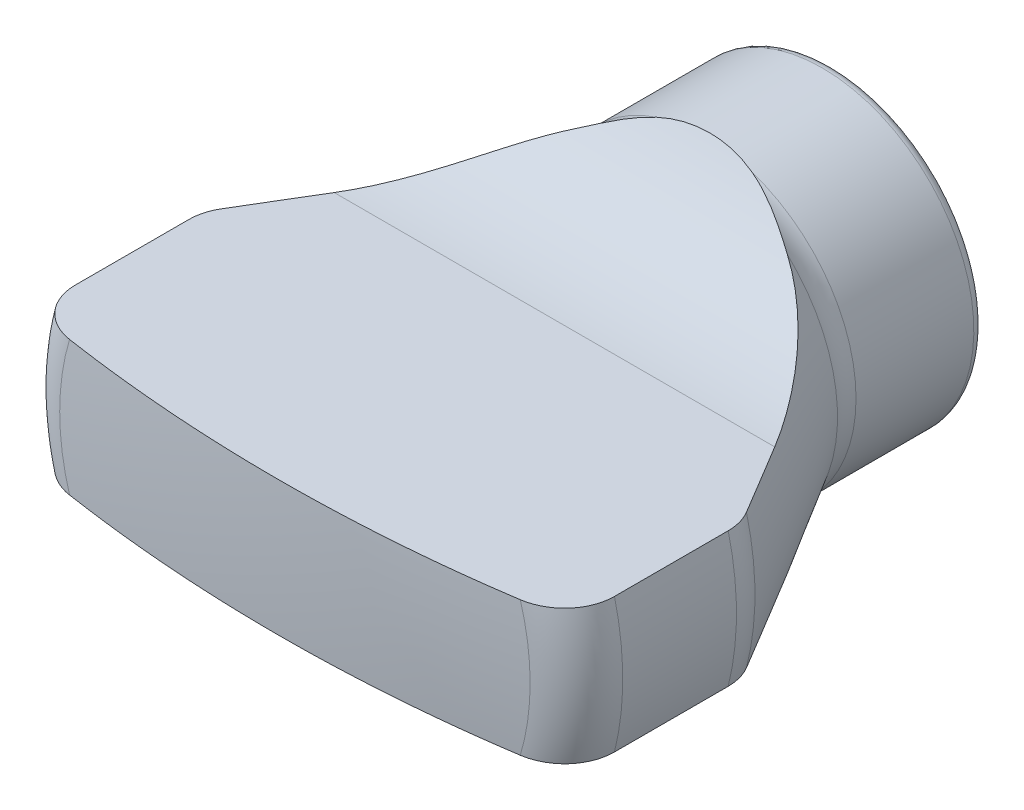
ISO-10303-21;
HEADER;
FILE_DESCRIPTION(('STEP AP214'),'2;1');
FILE_NAME('part.step','',(''),(''),'','','');
FILE_SCHEMA(('AUTOMOTIVE_DESIGN { 1 0 10303 214 1 1 1 1 }'));
ENDSEC;
DATA;
#1=APPLICATION_CONTEXT('core data for automotive mechanical design processes');
#2=APPLICATION_PROTOCOL_DEFINITION('international standard','automotive_design',2000,#1);
#3=PRODUCT_CONTEXT('',#1,'mechanical');
#4=PRODUCT('Part','Part','',(#3));
#5=PRODUCT_RELATED_PRODUCT_CATEGORY('part','',(#4));
#6=PRODUCT_DEFINITION_FORMATION('','',#4);
#7=PRODUCT_DEFINITION_CONTEXT('part definition',#1,'design');
#8=PRODUCT_DEFINITION('design','',#6,#7);
#9=PRODUCT_DEFINITION_SHAPE('','',#8);
#10=(LENGTH_UNIT() NAMED_UNIT(*) SI_UNIT(.MILLI.,.METRE.));
#11=(NAMED_UNIT(*) PLANE_ANGLE_UNIT() SI_UNIT($,.RADIAN.));
#12=(NAMED_UNIT(*) SI_UNIT($,.STERADIAN.) SOLID_ANGLE_UNIT());
#13=UNCERTAINTY_MEASURE_WITH_UNIT(LENGTH_MEASURE(1.E-05),#10,'distance_accuracy_value','');
#14=(GEOMETRIC_REPRESENTATION_CONTEXT(3) GLOBAL_UNCERTAINTY_ASSIGNED_CONTEXT((#13)) GLOBAL_UNIT_ASSIGNED_CONTEXT((#10,
#11,#12)) REPRESENTATION_CONTEXT('',''));
#15=CARTESIAN_POINT('',(0.,0.,0.));
#16=DIRECTION('',(0.,0.,1.));
#17=DIRECTION('',(1.,0.,0.));
#18=AXIS2_PLACEMENT_3D('',#15,#16,#17);
#19=CARTESIAN_POINT('',(1.2490009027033E-13,0.,-56.9999999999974));
#20=DIRECTION('',(0.,0.,-1.));
#21=DIRECTION('',(1.,0.,0.));
#22=AXIS2_PLACEMENT_3D('',#19,#20,#21);
#23=SPHERICAL_SURFACE('',#22,89.9999999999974);
#24=CARTESIAN_POINT('',(0.,0.,31.9098663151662));
#25=DIRECTION('',(0.,0.,-1.));
#26=DIRECTION('',(0.,1.,0.));
#27=AXIS2_PLACEMENT_3D('',#24,#25,#26);
#28=CIRCLE('',#27,13.9655172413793);
#29=CARTESIAN_POINT('',(-13.3804212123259,-4.,31.9098663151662));
#30=VERTEX_POINT('',#29);
#31=CARTESIAN_POINT('',(-13.380421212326,4.,31.9098663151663));
#32=VERTEX_POINT('',#31);
#33=EDGE_CURVE('E329',#30,#32,#28,.T.);
#34=ORIENTED_EDGE('',*,*,#33,.F.);
#35=CARTESIAN_POINT('',(1.2490009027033E-13,-4.,-56.9999999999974));
#36=DIRECTION('',(0.,-1.,0.));
#37=DIRECTION('',(1.,0.,0.));
#38=AXIS2_PLACEMENT_3D('',#35,#36,#37);
#39=CIRCLE('',#38,89.9110671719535);
#40=CARTESIAN_POINT('',(13.380421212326,-4.,31.9098663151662));
#41=VERTEX_POINT('',#40);
#42=EDGE_CURVE('E287',#30,#41,#39,.F.);
#43=ORIENTED_EDGE('',*,*,#42,.T.);
#44=CARTESIAN_POINT('',(13.380421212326,4.,31.9098663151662));
#45=VERTEX_POINT('',#44);
#46=EDGE_CURVE('E330',#45,#41,#28,.T.);
#47=ORIENTED_EDGE('',*,*,#46,.F.);
#48=CARTESIAN_POINT('',(1.2490009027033E-13,4.,-56.9999999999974));
#49=DIRECTION('',(0.,1.,0.));
#50=DIRECTION('',(-1.,0.,0.));
#51=AXIS2_PLACEMENT_3D('',#48,#49,#50);
#52=CIRCLE('',#51,89.9110671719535);
#53=EDGE_CURVE('E309',#45,#32,#52,.F.);
#54=ORIENTED_EDGE('',*,*,#53,.T.);
#55=EDGE_LOOP('',(#34,#43,#47,#54));
#56=FACE_BOUND('',#55,.T.);
#57=ADVANCED_FACE('F14',(#56),#23,.T.);
#58=CARTESIAN_POINT('',(0.,0.,28.9462041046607));
#59=DIRECTION('',(0.,0.,-1.));
#60=DIRECTION('',(0.,1.,0.));
#61=AXIS2_PLACEMENT_3D('',#58,#59,#60);
#62=TOROIDAL_SURFACE('',#61,13.5,3.);
#63=CARTESIAN_POINT('',(0.,0.,28.9462041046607));
#64=DIRECTION('',(0.,0.,-1.));
#65=DIRECTION('',(0.,1.,0.));
#66=AXIS2_PLACEMENT_3D('',#63,#64,#65);
#67=CIRCLE('',#66,16.5);
#68=CARTESIAN_POINT('',(-16.0078105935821,-4.,28.9462041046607));
#69=VERTEX_POINT('',#68);
#70=CARTESIAN_POINT('',(-16.0078105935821,4.,28.9462041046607));
#71=VERTEX_POINT('',#70);
#72=EDGE_CURVE('E326',#69,#71,#67,.T.);
#73=ORIENTED_EDGE('',*,*,#72,.F.);
#74=CARTESIAN_POINT('',(-15.5672699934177,-4.,30.4888967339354));
#75=CARTESIAN_POINT('',(-15.4772586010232,-4.,30.6342804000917));
#76=CARTESIAN_POINT('',(-15.3745935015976,-4.,30.772008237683));
#77=CARTESIAN_POINT('',(-15.1473134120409,-4.,31.0282016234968));
#78=CARTESIAN_POINT('',(-15.0226642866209,-4.,31.1466366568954));
#79=CARTESIAN_POINT('',(-14.7556290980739,-4.,31.3608610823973));
#80=CARTESIAN_POINT('',(-14.6132774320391,-4.,31.4566933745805));
#81=CARTESIAN_POINT('',(-14.3148983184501,-4.,31.6237673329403));
#82=CARTESIAN_POINT('',(-14.1588743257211,-4.,31.6950151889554));
#83=CARTESIAN_POINT('',(-13.8332078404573,-4.,31.8130838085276));
#84=CARTESIAN_POINT('',(-13.6633154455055,-4.,31.8592146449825));
#85=CARTESIAN_POINT('',(-13.3183015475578,-4.,31.9233884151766));
#86=CARTESIAN_POINT('',(-13.1431788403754,-4.,31.9414248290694));
#87=CARTESIAN_POINT('',(-12.786003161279,-4.,31.9494615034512));
#88=CARTESIAN_POINT('',(-12.6039267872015,-4.,31.9384336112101));
#89=CARTESIAN_POINT('',(-12.2440271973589,-4.,31.8867018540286));
#90=CARTESIAN_POINT('',(-12.0662047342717,-4.,31.8459927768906));
#91=CARTESIAN_POINT('',(-11.7156161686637,-4.,31.7347374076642));
#92=CARTESIAN_POINT('',(-11.5430603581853,-4.,31.6635265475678));
#93=CARTESIAN_POINT('',(-11.2124429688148,-4.,31.4929295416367));
#94=CARTESIAN_POINT('',(-11.0543823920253,-4.,31.3935414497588));
#95=CARTESIAN_POINT('',(-10.7590112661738,-4.,31.169853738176));
#96=CARTESIAN_POINT('',(-10.6215392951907,-4.,31.0457678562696));
#97=CARTESIAN_POINT('',(-10.3707169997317,-4.,30.7751887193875));
#98=CARTESIAN_POINT('',(-10.2573597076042,-4.,30.6287019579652));
#99=CARTESIAN_POINT('',(-10.0645124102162,-4.,30.3252094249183));
#100=CARTESIAN_POINT('',(-9.98360094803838,-4.,30.1691087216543));
#101=CARTESIAN_POINT('',(-9.85144486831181,-4.,29.8448233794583));
#102=CARTESIAN_POINT('',(-9.80018354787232,-4.,29.6766456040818));
#103=CARTESIAN_POINT('',(-9.73238180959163,-4.,29.3458390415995));
#104=CARTESIAN_POINT('',(-9.71364180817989,-4.,29.1836592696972));
#105=CARTESIAN_POINT('',(-9.70486868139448,-4.,28.8585429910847));
#106=CARTESIAN_POINT('',(-9.71482810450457,-4.,28.6956066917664));
#107=CARTESIAN_POINT('',(-9.76202688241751,-4.,28.3801907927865));
#108=CARTESIAN_POINT('',(-9.79820264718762,-4.,28.2275500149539));
#109=CARTESIAN_POINT('',(-9.89509360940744,-4.,27.9302894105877));
#110=CARTESIAN_POINT('',(-9.95581082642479,-4.,27.7856702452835));
#111=CARTESIAN_POINT('',(-10.1011602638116,-4.,27.5047226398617));
#112=CARTESIAN_POINT('',(-10.1863187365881,-4.,27.3686673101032));
#113=CARTESIAN_POINT('',(-10.376966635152,-4.,27.11165887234));
#114=CARTESIAN_POINT('',(-10.4824614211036,-4.,26.9907097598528));
#115=CARTESIAN_POINT('',(-10.7179359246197,-4.,26.7591262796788));
#116=CARTESIAN_POINT('',(-10.8490495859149,-4.,26.6496451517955));
#117=CARTESIAN_POINT('',(-11.1268833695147,-4.,26.4527041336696));
#118=CARTESIAN_POINT('',(-11.2736082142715,-4.,26.3652509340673));
#119=CARTESIAN_POINT('',(-11.5882701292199,-4.,26.2094276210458));
#120=CARTESIAN_POINT('',(-11.7569576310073,-4.,26.1425698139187));
#121=CARTESIAN_POINT('',(-12.1029781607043,-4.,26.0372047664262));
#122=CARTESIAN_POINT('',(-12.2803128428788,-4.,25.9987029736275));
#123=CARTESIAN_POINT('',(-12.6441019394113,-4.,25.9504387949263));
#124=CARTESIAN_POINT('',(-12.8306717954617,-4.,25.9415393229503));
#125=CARTESIAN_POINT('',(-13.2026426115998,-4.,25.9554642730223));
#126=CARTESIAN_POINT('',(-13.3880435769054,-4.,25.9782885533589));
#127=CARTESIAN_POINT('',(-13.7505898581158,-4.,26.0551415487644));
#128=CARTESIAN_POINT('',(-13.9277932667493,-4.,26.1088951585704));
#129=CARTESIAN_POINT('',(-14.2701862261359,-4.,26.2463691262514));
#130=CARTESIAN_POINT('',(-14.435377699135,-4.,26.3300846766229));
#131=CARTESIAN_POINT('',(-14.7433052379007,-4.,26.5223111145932));
#132=CARTESIAN_POINT('',(-14.8865922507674,-4.,26.6299389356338));
#133=CARTESIAN_POINT('',(-15.1521638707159,-4.,26.8685814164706));
#134=CARTESIAN_POINT('',(-15.2744530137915,-4.,26.9995910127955));
#135=CARTESIAN_POINT('',(-15.4897156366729,-4.,27.2759738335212));
#136=CARTESIAN_POINT('',(-15.5836145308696,-4.,27.4206265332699));
#137=CARTESIAN_POINT('',(-15.7449147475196,-4.,27.7240140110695));
#138=CARTESIAN_POINT('',(-15.8123221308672,-4.,27.8827455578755));
#139=CARTESIAN_POINT('',(-15.9167341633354,-4.,28.2046447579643));
#140=CARTESIAN_POINT('',(-15.9545893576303,-4.,28.367536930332));
#141=CARTESIAN_POINT('',(-16.0019383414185,-4.,28.6974384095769));
#142=CARTESIAN_POINT('',(-16.01142751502,-4.,28.8644483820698));
#143=CARTESIAN_POINT('',(-16.0017948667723,-4.,29.1950745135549));
#144=CARTESIAN_POINT('',(-15.9831048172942,-4.,29.3587037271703));
#145=CARTESIAN_POINT('',(-15.9185204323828,-4.,29.6803420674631));
#146=CARTESIAN_POINT('',(-15.8726625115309,-4.,29.8383584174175));
#147=CARTESIAN_POINT('',(-15.7808385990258,-4.,30.0779173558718));
#148=CARTESIAN_POINT('',(-15.7435543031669,-4.,30.1628905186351));
#149=CARTESIAN_POINT('',(-15.661177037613,-4.,30.3289585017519));
#150=CARTESIAN_POINT('',(-15.6160842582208,-4.,30.4100534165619));
#151=CARTESIAN_POINT('',(-15.5672699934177,-4.,30.4888967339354));
#152=B_SPLINE_CURVE_WITH_KNOTS('',3,(#74,#75,#76,#77,#78,#79,#80,#81,#82,#83,#84,#85,#86,#87,
#88,#89,#90,#91,#92,#93,#94,#95,#96,#97,#98,#99,#100,#101,#102,#103,#104,#105,#106,#107,#108,
#109,#110,#111,#112,#113,#114,#115,#116,#117,#118,#119,#120,#121,#122,#123,#124,#125,#126,#127,
#128,#129,#130,#131,#132,#133,#134,#135,#136,#137,#138,#139,#140,#141,#142,#143,#144,#145,#146,
#147,#148,#149,#150,#151),.UNSPECIFIED.,.T.,.F.,(4,2,2,2,2,2,2,2,2,2,2,2,2,2,2,2,2,2,2,2,2,2,2,
2,2,2,2,2,2,2,2,2,2,2,2,2,2,2,4),(0.,0.512625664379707,1.02605442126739,1.53850070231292,
2.05081786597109,2.57657647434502,3.10245707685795,3.6471882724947,4.19201514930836,
4.74937006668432,5.30676348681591,5.85952791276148,6.4121324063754,6.93682425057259,
7.46122023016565,7.94852146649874,8.43569619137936,8.90413987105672,9.37262210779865,
9.85206433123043,10.3316330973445,10.8418512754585,11.3522242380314,11.8941206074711,
12.4361210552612,12.9937886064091,13.5514536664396,14.1042335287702,14.6569247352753,
15.191858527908,15.7266766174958,16.2414908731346,16.7561872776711,17.255459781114,
17.7548135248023,18.2465933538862,18.7377155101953,19.0157253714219,19.2937284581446),.UNSPECIFIED.);
#153=EDGE_CURVE('E339',#69,#30,#152,.T.);
#154=ORIENTED_EDGE('',*,*,#153,.T.);
#155=ORIENTED_EDGE('',*,*,#33,.T.);
#156=CARTESIAN_POINT('',(-15.5672699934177,4.,30.4888967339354));
#157=CARTESIAN_POINT('',(-15.6539840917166,4.,30.3488094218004));
#158=CARTESIAN_POINT('',(-15.7290828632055,4.,30.201409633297));
#159=CARTESIAN_POINT('',(-15.8535924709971,4.,29.8960069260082));
#160=CARTESIAN_POINT('',(-15.9029790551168,4.,29.737994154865));
#161=CARTESIAN_POINT('',(-15.9743976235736,4.,29.415865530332));
#162=CARTESIAN_POINT('',(-15.9964268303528,4.,29.2517490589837));
#163=CARTESIAN_POINT('',(-16.0123824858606,4.,28.9221905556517));
#164=CARTESIAN_POINT('',(-16.0063148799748,4.,28.7567488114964));
#165=CARTESIAN_POINT('',(-15.9664392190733,4.,28.4304553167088));
#166=CARTESIAN_POINT('',(-15.9328303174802,4.,28.2695791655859));
#167=CARTESIAN_POINT('',(-15.8392125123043,4.,27.9557078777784));
#168=CARTESIAN_POINT('',(-15.7792029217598,4.,27.8027129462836));
#169=CARTESIAN_POINT('',(-15.6343057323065,4.,27.5080236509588));
#170=CARTESIAN_POINT('',(-15.5492908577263,4.,27.3663919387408));
#171=CARTESIAN_POINT('',(-15.357136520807,4.,27.0990462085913));
#172=CARTESIAN_POINT('',(-15.2499954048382,4.,26.9733333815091));
#173=CARTESIAN_POINT('',(-15.0143863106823,4.,26.738567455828));
#174=CARTESIAN_POINT('',(-14.8855278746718,4.,26.6299065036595));
#175=CARTESIAN_POINT('',(-14.6118783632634,4.,26.4349733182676));
#176=CARTESIAN_POINT('',(-14.4670851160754,4.,26.3487041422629));
#177=CARTESIAN_POINT('',(-14.1607735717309,4.,26.1980181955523));
#178=CARTESIAN_POINT('',(-13.9988687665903,4.,26.1343874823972));
#179=CARTESIAN_POINT('',(-13.6669092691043,4.,26.0341413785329));
#180=CARTESIAN_POINT('',(-13.496853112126,4.,25.9975308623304));
#181=CARTESIAN_POINT('',(-13.1467971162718,4.,25.9510024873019));
#182=CARTESIAN_POINT('',(-12.9666609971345,4.,25.9421089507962));
#183=CARTESIAN_POINT('',(-12.6073389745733,4.,25.9537658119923));
#184=CARTESIAN_POINT('',(-12.4281532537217,4.,25.9743216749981));
#185=CARTESIAN_POINT('',(-12.0703007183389,4.,26.0451822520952));
#186=CARTESIAN_POINT('',(-11.8918019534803,4.,26.0963384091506));
#187=CARTESIAN_POINT('',(-11.545819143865,4.,26.2277400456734));
#188=CARTESIAN_POINT('',(-11.3783365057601,4.,26.30798923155));
#189=CARTESIAN_POINT('',(-11.0586512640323,4.,26.4960917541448));
#190=CARTESIAN_POINT('',(-10.9065170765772,4.,26.60406168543));
#191=CARTESIAN_POINT('',(-10.6233709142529,4.,26.8449003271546));
#192=CARTESIAN_POINT('',(-10.4923559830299,4.,26.9777655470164));
#193=CARTESIAN_POINT('',(-10.2607609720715,4.,27.2597371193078));
#194=CARTESIAN_POINT('',(-10.159241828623,4.,27.4080702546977));
#195=CARTESIAN_POINT('',(-9.98472069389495,4.,27.7206648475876));
#196=CARTESIAN_POINT('',(-9.911703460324,4.,27.8849177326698));
#197=CARTESIAN_POINT('',(-9.80165650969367,4.,28.2124740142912));
#198=CARTESIAN_POINT('',(-9.76249011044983,4.,28.3750599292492));
#199=CARTESIAN_POINT('',(-9.71379679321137,4.,28.7045947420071));
#200=CARTESIAN_POINT('',(-9.7042580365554,4.,28.8715418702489));
#201=CARTESIAN_POINT('',(-9.71496333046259,4.,29.1952344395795));
#202=CARTESIAN_POINT('',(-9.7335978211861,4.,29.3520358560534));
#203=CARTESIAN_POINT('',(-9.79688299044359,4.,29.6602766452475));
#204=CARTESIAN_POINT('',(-9.84153338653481,4.,29.8117160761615));
#205=CARTESIAN_POINT('',(-9.9551482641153,4.,30.1056073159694));
#206=CARTESIAN_POINT('',(-10.0241781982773,4.,30.2480337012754));
#207=CARTESIAN_POINT('',(-10.1839660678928,4.,30.5201023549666));
#208=CARTESIAN_POINT('',(-10.2747286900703,4.,30.6497418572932));
#209=CARTESIAN_POINT('',(-10.4805680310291,4.,30.9002219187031));
#210=CARTESIAN_POINT('',(-10.5967050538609,4.,31.0201902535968));
#211=CARTESIAN_POINT('',(-10.8463411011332,4.,31.2404368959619));
#212=CARTESIAN_POINT('',(-10.9798454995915,4.,31.3407090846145));
#213=CARTESIAN_POINT('',(-11.2700484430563,4.,31.5256390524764));
#214=CARTESIAN_POINT('',(-11.4277017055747,4.,31.6088004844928));
#215=CARTESIAN_POINT('',(-11.7543288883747,4.,31.748715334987));
#216=CARTESIAN_POINT('',(-11.9233055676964,4.,31.8054622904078));
#217=CARTESIAN_POINT('',(-12.2754048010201,4.,31.8930040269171));
#218=CARTESIAN_POINT('',(-12.458823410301,4.,31.9226134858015));
#219=CARTESIAN_POINT('',(-12.8280402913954,4.,31.9507376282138));
#220=CARTESIAN_POINT('',(-13.0138386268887,4.,31.9492514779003));
#221=CARTESIAN_POINT('',(-13.3830553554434,4.,31.9148112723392));
#222=CARTESIAN_POINT('',(-13.5664655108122,4.,31.8817680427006));
#223=CARTESIAN_POINT('',(-13.9248981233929,4.,31.7845043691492));
#224=CARTESIAN_POINT('',(-14.0999194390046,4.,31.7202796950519));
#225=CARTESIAN_POINT('',(-14.4315859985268,4.,31.5641005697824));
#226=CARTESIAN_POINT('',(-14.5885896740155,4.,31.4729070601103));
#227=CARTESIAN_POINT('',(-14.884102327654,4.,31.2645429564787));
#228=CARTESIAN_POINT('',(-15.0226381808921,4.,31.1474107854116));
#229=CARTESIAN_POINT('',(-15.2288535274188,4.,30.9388224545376));
#230=CARTESIAN_POINT('',(-15.303605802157,4.,30.8542409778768));
#231=CARTESIAN_POINT('',(-15.4431418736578,4.,30.677213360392));
#232=CARTESIAN_POINT('',(-15.5079259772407,4.,30.5847674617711));
#233=CARTESIAN_POINT('',(-15.5672699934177,4.,30.4888967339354));
#234=B_SPLINE_CURVE_WITH_KNOTS('',3,(#156,#157,#158,#159,#160,#161,#162,#163,#164,#165,#166,
#167,#168,#169,#170,#171,#172,#173,#174,#175,#176,#177,#178,#179,#180,#181,#182,#183,#184,#185,
#186,#187,#188,#189,#190,#191,#192,#193,#194,#195,#196,#197,#198,#199,#200,#201,#202,#203,#204,
#205,#206,#207,#208,#209,#210,#211,#212,#213,#214,#215,#216,#217,#218,#219,#220,#221,#222,#223,
#224,#225,#226,#227,#228,#229,#230,#231,#232,#233),.UNSPECIFIED.,.T.,.F.,(4,2,2,2,2,2,2,2,2,2,2,
2,2,2,2,2,2,2,2,2,2,2,2,2,2,2,2,2,2,2,2,2,2,2,2,2,2,2,4),(0.,0.493858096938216,
0.988181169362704,1.48255442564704,1.97682307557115,2.46754884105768,2.95828737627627,
3.45156829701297,3.94488609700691,4.44826693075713,4.95171645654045,5.47124768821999,
5.99087262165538,6.52948626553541,7.06819987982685,7.62264965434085,8.17717008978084,
8.734062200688,9.29087628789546,9.82729359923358,10.3634236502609,10.8625363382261,
11.3614495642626,11.8329163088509,12.3043779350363,12.7771150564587,13.2499542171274,
13.7487199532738,14.2476403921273,14.7799895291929,15.3124688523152,15.8672295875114,
16.4220051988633,16.9783531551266,17.5347766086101,18.076794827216,18.6180154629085,
18.9560046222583,19.2939833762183),.UNSPECIFIED.);
#235=EDGE_CURVE('E296',#32,#71,#234,.T.);
#236=ORIENTED_EDGE('',*,*,#235,.T.);
#237=EDGE_LOOP('',(#73,#154,#155,#236));
#238=FACE_BOUND('',#237,.T.);
#239=ADVANCED_FACE('F289',(#238),#62,.T.);
#240=CARTESIAN_POINT('',(16.0078105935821,4.,28.9462041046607));
#241=VERTEX_POINT('',#240);
#242=CARTESIAN_POINT('',(16.0078105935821,-4.,28.9462041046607));
#243=VERTEX_POINT('',#242);
#244=EDGE_CURVE('E327',#241,#243,#67,.T.);
#245=ORIENTED_EDGE('',*,*,#244,.F.);
#246=CARTESIAN_POINT('',(9.96025197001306,4.,30.1064265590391));
#247=CARTESIAN_POINT('',(9.89525211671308,4.,29.9625848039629));
#248=CARTESIAN_POINT('',(9.84198105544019,4.,29.8133594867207));
#249=CARTESIAN_POINT('',(9.76110669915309,4.,29.5080259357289));
#250=CARTESIAN_POINT('',(9.73351553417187,4.,29.3519144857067));
#251=CARTESIAN_POINT('',(9.70524026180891,4.,29.0371450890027));
#252=CARTESIAN_POINT('',(9.70457462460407,4.,28.8784854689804));
#253=CARTESIAN_POINT('',(9.7302321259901,4.,28.5633921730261));
#254=CARTESIAN_POINT('',(9.75655265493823,4.,28.4069582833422));
#255=CARTESIAN_POINT('',(9.83460345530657,4.,28.1022974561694));
#256=CARTESIAN_POINT('',(9.8860728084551,4.,27.9540032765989));
#257=CARTESIAN_POINT('',(10.0122438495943,4.,27.6676749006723));
#258=CARTESIAN_POINT('',(10.0869495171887,4.,27.5296424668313));
#259=CARTESIAN_POINT('',(10.2603554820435,4.,27.2617257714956));
#260=CARTESIAN_POINT('',(10.3598915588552,4.,27.1323835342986));
#261=CARTESIAN_POINT('',(10.5779888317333,4.,26.8908999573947));
#262=CARTESIAN_POINT('',(10.6965555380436,4.,26.7787636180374));
#263=CARTESIAN_POINT('',(10.9579398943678,4.,26.5669011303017));
#264=CARTESIAN_POINT('',(11.101856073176,4.,26.4685296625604));
#265=CARTESIAN_POINT('',(11.4034812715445,4.,26.2958787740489));
#266=CARTESIAN_POINT('',(11.5611941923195,4.,26.2216061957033));
#267=CARTESIAN_POINT('',(11.8951062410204,4.,26.0954031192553));
#268=CARTESIAN_POINT('',(12.071843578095,4.,26.0448924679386));
#269=CARTESIAN_POINT('',(12.4312419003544,4.,25.9736943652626));
#270=CARTESIAN_POINT('',(12.6139036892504,4.,25.9530109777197));
#271=CARTESIAN_POINT('',(12.9832312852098,4.,25.9421528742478));
#272=CARTESIAN_POINT('',(13.1699128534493,4.,25.952495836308));
#273=CARTESIAN_POINT('',(13.5387763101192,4.,26.0049553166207));
#274=CARTESIAN_POINT('',(13.720958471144,4.,26.047069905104));
#275=CARTESIAN_POINT('',(14.0720740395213,4.,26.1613360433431));
#276=CARTESIAN_POINT('',(14.2411858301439,4.,26.2329382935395));
#277=CARTESIAN_POINT('',(14.5643497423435,4.,26.4045350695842));
#278=CARTESIAN_POINT('',(14.7184047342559,4.,26.5045241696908));
#279=CARTESIAN_POINT('',(15.001189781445,4.,26.726279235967));
#280=CARTESIAN_POINT('',(15.1306247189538,4.,26.8471461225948));
#281=CARTESIAN_POINT('',(15.3664223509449,4.,27.1096169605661));
#282=CARTESIAN_POINT('',(15.4727900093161,4.,27.2512164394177));
#283=CARTESIAN_POINT('',(15.6554098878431,4.,27.545581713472));
#284=CARTESIAN_POINT('',(15.7326121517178,4.,27.6977584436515));
#285=CARTESIAN_POINT('',(15.8595887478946,4.,28.0131543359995));
#286=CARTESIAN_POINT('',(15.9093676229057,4.,28.1763716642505));
#287=CARTESIAN_POINT('',(15.9788784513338,4.,28.5046388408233));
#288=CARTESIAN_POINT('',(15.9993578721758,4.,28.6695307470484));
#289=CARTESIAN_POINT('',(16.0120099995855,4.,29.000391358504));
#290=CARTESIAN_POINT('',(16.0041851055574,4.,29.1663599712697));
#291=CARTESIAN_POINT('',(15.9607296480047,4.,29.4927830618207));
#292=CARTESIAN_POINT('',(15.9253994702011,4.,29.6532776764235));
#293=CARTESIAN_POINT('',(15.8284418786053,4.,29.9661060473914));
#294=CARTESIAN_POINT('',(15.7668144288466,4.,30.1184397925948));
#295=CARTESIAN_POINT('',(15.6187850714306,4.,30.4116302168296));
#296=CARTESIAN_POINT('',(15.5322439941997,4.,30.5524165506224));
#297=CARTESIAN_POINT('',(15.3372065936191,4.,30.8178403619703));
#298=CARTESIAN_POINT('',(15.2287085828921,4.,30.9424765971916));
#299=CARTESIAN_POINT('',(14.9905115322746,4.,31.1749226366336));
#300=CARTESIAN_POINT('',(14.8604178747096,4.,31.2823277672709));
#301=CARTESIAN_POINT('',(14.5845219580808,4.,31.474572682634));
#302=CARTESIAN_POINT('',(14.4387174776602,4.,31.5594092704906));
#303=CARTESIAN_POINT('',(14.1305583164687,4.,31.7070670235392));
#304=CARTESIAN_POINT('',(13.9678217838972,4.,31.769090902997));
#305=CARTESIAN_POINT('',(13.6344692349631,4.,31.8660100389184));
#306=CARTESIAN_POINT('',(13.4638517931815,4.,31.9009003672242));
#307=CARTESIAN_POINT('',(13.112938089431,4.,31.9438518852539));
#308=CARTESIAN_POINT('',(12.9325159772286,4.,31.9508860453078));
#309=CARTESIAN_POINT('',(12.5729360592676,4.,31.9354736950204));
#310=CARTESIAN_POINT('',(12.3937784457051,4.,31.9130227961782));
#311=CARTESIAN_POINT('',(12.0364085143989,4.,31.8383425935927));
#312=CARTESIAN_POINT('',(11.8583698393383,4.,31.7852798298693));
#313=CARTESIAN_POINT('',(11.5135875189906,4.,31.6501183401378));
#314=CARTESIAN_POINT('',(11.3468480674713,4.,31.5680089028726));
#315=CARTESIAN_POINT('',(11.0291007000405,4.,31.3763522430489));
#316=CARTESIAN_POINT('',(10.878152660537,4.,31.2667055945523));
#317=CARTESIAN_POINT('',(10.5978429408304,4.,31.0227887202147));
#318=CARTESIAN_POINT('',(10.4684516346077,4.,30.8885528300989));
#319=CARTESIAN_POINT('',(10.274024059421,4.,30.6462593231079));
#320=CARTESIAN_POINT('',(10.2017573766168,4.,30.5439279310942));
#321=CARTESIAN_POINT('',(10.0706242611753,4.,30.3309992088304));
#322=CARTESIAN_POINT('',(10.0117561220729,4.,30.2204029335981));
#323=CARTESIAN_POINT('',(9.96025197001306,4.,30.1064265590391));
#324=B_SPLINE_CURVE_WITH_KNOTS('',3,(#246,#247,#248,#249,#250,#251,#252,#253,#254,#255,#256,
#257,#258,#259,#260,#261,#262,#263,#264,#265,#266,#267,#268,#269,#270,#271,#272,#273,#274,#275,
#276,#277,#278,#279,#280,#281,#282,#283,#284,#285,#286,#287,#288,#289,#290,#291,#292,#293,#294,
#295,#296,#297,#298,#299,#300,#301,#302,#303,#304,#305,#306,#307,#308,#309,#310,#311,#312,#313,
#314,#315,#316,#317,#318,#319,#320,#321,#322,#323),.UNSPECIFIED.,.T.,.F.,(4,2,2,2,2,2,2,2,2,2,2,
2,2,2,2,2,2,2,2,2,2,2,2,2,2,2,2,2,2,2,2,2,2,2,2,2,2,2,4),(0.,0.473108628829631,
0.946440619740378,1.42009729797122,1.89370817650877,2.36250646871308,2.83138509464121,
3.31890249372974,3.80656130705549,4.32724447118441,4.84807534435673,5.39697610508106,
5.94595164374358,6.50413756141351,7.06228957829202,7.61048351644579,8.15857274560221,
8.68720500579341,9.2157233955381,9.72512702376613,10.2344462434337,10.7305250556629,
11.2265618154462,11.7172560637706,12.2079509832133,12.7014419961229,13.1949709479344,
13.6987823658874,14.2026651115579,14.7227807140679,15.2429907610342,15.7822112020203,
16.3215119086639,16.8762396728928,17.4311722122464,17.988137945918,18.5443317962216,
18.9192582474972,19.2941369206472),.UNSPECIFIED.);
#325=EDGE_CURVE('E303',#241,#45,#324,.T.);
#326=ORIENTED_EDGE('',*,*,#325,.T.);
#327=ORIENTED_EDGE('',*,*,#46,.T.);
#328=CARTESIAN_POINT('',(9.96025197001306,-4.,30.1064265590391));
#329=CARTESIAN_POINT('',(10.0310673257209,-4.,30.2630997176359));
#330=CARTESIAN_POINT('',(10.1159160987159,-4.,30.4136229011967));
#331=CARTESIAN_POINT('',(10.3101520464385,-4.,30.6981411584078));
#332=CARTESIAN_POINT('',(10.4195897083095,-4.,30.8321013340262));
#333=CARTESIAN_POINT('',(10.6586224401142,-4.,31.0797275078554));
#334=CARTESIAN_POINT('',(10.7881490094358,-4.,31.1934597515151));
#335=CARTESIAN_POINT('',(11.063601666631,-4.,31.3987440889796));
#336=CARTESIAN_POINT('',(11.209522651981,-4.,31.4903030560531));
#337=CARTESIAN_POINT('',(11.5213418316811,-4.,31.6533793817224));
#338=CARTESIAN_POINT('',(11.687868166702,-4.,31.7236968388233));
#339=CARTESIAN_POINT('',(12.030149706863,-4.,31.8363846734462));
#340=CARTESIAN_POINT('',(12.2059074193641,-4.,31.8787474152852));
#341=CARTESIAN_POINT('',(12.5676952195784,-4.,31.9352713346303));
#342=CARTESIAN_POINT('',(12.7538740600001,-4.,31.9484870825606));
#343=CARTESIAN_POINT('',(13.1258070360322,-4.,31.9432762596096));
#344=CARTESIAN_POINT('',(13.3115611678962,-4.,31.9248494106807));
#345=CARTESIAN_POINT('',(13.6760013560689,-4.,31.8566451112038));
#346=CARTESIAN_POINT('',(13.8547254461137,-4.,31.8070718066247));
#347=CARTESIAN_POINT('',(14.2008776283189,-4.,31.677663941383));
#348=CARTESIAN_POINT('',(14.3683075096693,-4.,31.5978341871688));
#349=CARTESIAN_POINT('',(14.6814648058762,-4.,31.4127388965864));
#350=CARTESIAN_POINT('',(14.8277054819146,-4.,31.3083423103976));
#351=CARTESIAN_POINT('',(15.099701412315,-4.,31.0755935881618));
#352=CARTESIAN_POINT('',(15.2254610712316,-4.,30.9472466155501));
#353=CARTESIAN_POINT('',(15.4479154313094,-4.,30.6754538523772));
#354=CARTESIAN_POINT('',(15.5455241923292,-4.,30.5327559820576));
#355=CARTESIAN_POINT('',(15.7145077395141,-4.,30.2325886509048));
#356=CARTESIAN_POINT('',(15.7858875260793,-4.,30.0751220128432));
#357=CARTESIAN_POINT('',(15.8982016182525,-4.,29.7551100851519));
#358=CARTESIAN_POINT('',(15.9400020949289,-4.,29.5928684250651));
#359=CARTESIAN_POINT('',(15.9952535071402,-4.,29.2636312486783));
#360=CARTESIAN_POINT('',(16.008707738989,-4.,29.096636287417));
#361=CARTESIAN_POINT('',(16.0068360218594,-4.,28.7656217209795));
#362=CARTESIAN_POINT('',(15.9919889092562,-4.,28.6015991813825));
#363=CARTESIAN_POINT('',(15.9349468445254,-4.,28.2783892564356));
#364=CARTESIAN_POINT('',(15.8927527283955,-4.,28.1192017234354));
#365=CARTESIAN_POINT('',(15.782400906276,-4.,27.8101857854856));
#366=CARTESIAN_POINT('',(15.7142541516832,-4.,27.6603534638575));
#367=CARTESIAN_POINT('',(15.5541403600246,-4.,27.3740224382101));
#368=CARTESIAN_POINT('',(15.462172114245,-4.,27.2375244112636));
#369=CARTESIAN_POINT('',(15.2556167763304,-4.,26.979389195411));
#370=CARTESIAN_POINT('',(15.1407015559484,-4.,26.8580147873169));
#371=CARTESIAN_POINT('',(14.8926285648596,-4.,26.6356358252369));
#372=CARTESIAN_POINT('',(14.7594686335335,-4.,26.5346336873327));
#373=CARTESIAN_POINT('',(14.4746744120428,-4.,26.3527190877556));
#374=CARTESIAN_POINT('',(14.3226208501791,-4.,26.2724633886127));
#375=CARTESIAN_POINT('',(14.0075423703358,-4.,26.1376127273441));
#376=CARTESIAN_POINT('',(13.8445156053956,-4.,26.0830220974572));
#377=CARTESIAN_POINT('',(13.5058639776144,-4.,25.9989727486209));
#378=CARTESIAN_POINT('',(13.3299968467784,-4.,25.9704901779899));
#379=CARTESIAN_POINT('',(12.9759725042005,-4.,25.9424153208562));
#380=CARTESIAN_POINT('',(12.7978148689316,-4.,25.9428284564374));
#381=CARTESIAN_POINT('',(12.4379436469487,-4.,25.9727264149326));
#382=CARTESIAN_POINT('',(12.256310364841,-4.,26.003182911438));
#383=CARTESIAN_POINT('',(11.9005447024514,-4.,26.0936731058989));
#384=CARTESIAN_POINT('',(11.7264135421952,-4.,26.1537115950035));
#385=CARTESIAN_POINT('',(11.3879963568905,-4.,26.3030015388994));
#386=CARTESIAN_POINT('',(11.2238970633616,-4.,26.39267745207));
#387=CARTESIAN_POINT('',(10.9134784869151,-4.,26.5988764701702));
#388=CARTESIAN_POINT('',(10.7671590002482,-4.,26.7153992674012));
#389=CARTESIAN_POINT('',(10.5002909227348,-4.,26.9696841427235));
#390=CARTESIAN_POINT('',(10.3792512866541,-4.,27.1069294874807));
#391=CARTESIAN_POINT('',(10.1637410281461,-4.,27.4009135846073));
#392=CARTESIAN_POINT('',(10.0692577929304,-4.,27.5576430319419));
#393=CARTESIAN_POINT('',(9.91601521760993,-4.,27.8758545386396));
#394=CARTESIAN_POINT('',(9.85541272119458,-4.,28.0364480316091));
#395=CARTESIAN_POINT('',(9.76419737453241,-4.,28.3659801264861));
#396=CARTESIAN_POINT('',(9.73357785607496,-4.,28.5349168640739));
#397=CARTESIAN_POINT('',(9.70485890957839,-4.,28.8642818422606));
#398=CARTESIAN_POINT('',(9.70475364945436,-4.,29.0245391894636));
#399=CARTESIAN_POINT('',(9.73207061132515,-4.,29.3425257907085));
#400=CARTESIAN_POINT('',(9.75945146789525,-4.,29.5002584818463));
#401=CARTESIAN_POINT('',(9.82019808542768,-4.,29.7318380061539));
#402=CARTESIAN_POINT('',(9.84380824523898,-4.,29.808375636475));
#403=CARTESIAN_POINT('',(9.89734930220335,-4.,29.9591952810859));
#404=CARTESIAN_POINT('',(9.92727944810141,-4.,30.0334775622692));
#405=CARTESIAN_POINT('',(9.96025197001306,-4.,30.1064265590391));
#406=B_SPLINE_CURVE_WITH_KNOTS('',3,(#328,#329,#330,#331,#332,#333,#334,#335,#336,#337,#338,
#339,#340,#341,#342,#343,#344,#345,#346,#347,#348,#349,#350,#351,#352,#353,#354,#355,#356,#357,
#358,#359,#360,#361,#362,#363,#364,#365,#366,#367,#368,#369,#370,#371,#372,#373,#374,#375,#376,
#377,#378,#379,#380,#381,#382,#383,#384,#385,#386,#387,#388,#389,#390,#391,#392,#393,#394,#395,
#396,#397,#398,#399,#400,#401,#402,#403,#404,#405),.UNSPECIFIED.,.T.,.F.,(4,2,2,2,2,2,2,2,2,2,2,
2,2,2,2,2,2,2,2,2,2,2,2,2,2,2,2,2,2,2,2,2,2,2,2,2,2,2,4),(0.,0.515486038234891,1.03204033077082,
1.54687046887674,2.06154081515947,2.60139504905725,3.14139668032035,3.69867137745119,
4.25595097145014,4.80961550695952,5.3631921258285,5.89954003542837,6.43577244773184,
6.95186954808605,7.46786820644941,7.96805006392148,8.46817375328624,8.95991078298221,
9.45163278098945,9.94314751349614,10.4346871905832,10.9338365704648,11.4330451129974,
11.9465229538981,12.4600874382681,12.9921517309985,13.524315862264,14.0742751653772,
14.6243235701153,15.1826181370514,15.740906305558,16.2870589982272,16.8329518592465,
17.3451930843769,17.8573203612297,18.3357751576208,18.81351097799,19.053556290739,
19.293573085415),.UNSPECIFIED.);
#407=EDGE_CURVE('E281',#41,#243,#406,.T.);
#408=ORIENTED_EDGE('',*,*,#407,.T.);
#409=EDGE_LOOP('',(#245,#326,#327,#408));
#410=FACE_BOUND('',#409,.T.);
#411=ADVANCED_FACE('F292',(#410),#62,.T.);
#412=CARTESIAN_POINT('',(0.,0.,0.));
#413=DIRECTION('',(0.,0.,-1.));
#414=DIRECTION('',(0.,1.,0.));
#415=AXIS2_PLACEMENT_3D('',#412,#413,#414);
#416=CYLINDRICAL_SURFACE('',#415,16.5);
#417=DIRECTION('',(0.,0.,-1.));
#418=VECTOR('',#417,1.);
#419=CARTESIAN_POINT('',(-16.0078105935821,-4.,0.));
#420=LINE('',#419,#418);
#421=CARTESIAN_POINT('',(-16.0078105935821,-4.,22.19422863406));
#422=VERTEX_POINT('',#421);
#423=EDGE_CURVE('E354',#69,#422,#420,.T.);
#424=ORIENTED_EDGE('',*,*,#423,.F.);
#425=ORIENTED_EDGE('',*,*,#72,.T.);
#426=DIRECTION('',(0.,0.,-1.));
#427=VECTOR('',#426,1.);
#428=CARTESIAN_POINT('',(-16.0078105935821,4.,0.));
#429=LINE('',#428,#427);
#430=CARTESIAN_POINT('',(-16.0078105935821,4.,22.19422863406));
#431=VERTEX_POINT('',#430);
#432=EDGE_CURVE('E253',#431,#71,#429,.F.);
#433=ORIENTED_EDGE('',*,*,#432,.F.);
#434=CARTESIAN_POINT('',(0.,0.,22.19422863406));
#435=DIRECTION('',(0.,0.,-1.));
#436=DIRECTION('',(0.,1.,0.));
#437=AXIS2_PLACEMENT_3D('',#434,#435,#436);
#438=CIRCLE('',#437,16.5);
#439=EDGE_CURVE('E317',#422,#431,#438,.T.);
#440=ORIENTED_EDGE('',*,*,#439,.F.);
#441=EDGE_LOOP('',(#424,#425,#433,#440));
#442=FACE_BOUND('',#441,.T.);
#443=ADVANCED_FACE('F262',(#442),#416,.T.);
#444=DIRECTION('',(0.,0.,-1.));
#445=VECTOR('',#444,1.);
#446=CARTESIAN_POINT('',(16.0078105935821,4.,0.));
#447=LINE('',#446,#445);
#448=CARTESIAN_POINT('',(16.0078105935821,4.,22.19422863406));
#449=VERTEX_POINT('',#448);
#450=EDGE_CURVE('E308',#241,#449,#447,.T.);
#451=ORIENTED_EDGE('',*,*,#450,.F.);
#452=ORIENTED_EDGE('',*,*,#244,.T.);
#453=DIRECTION('',(0.,0.,-1.));
#454=VECTOR('',#453,1.);
#455=CARTESIAN_POINT('',(16.0078105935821,-4.,0.));
#456=LINE('',#455,#454);
#457=CARTESIAN_POINT('',(16.0078105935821,-4.,22.19422863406));
#458=VERTEX_POINT('',#457);
#459=EDGE_CURVE('E279',#458,#243,#456,.F.);
#460=ORIENTED_EDGE('',*,*,#459,.F.);
#461=EDGE_CURVE('E314',#449,#458,#438,.T.);
#462=ORIENTED_EDGE('',*,*,#461,.F.);
#463=EDGE_LOOP('',(#451,#452,#460,#462));
#464=FACE_BOUND('',#463,.T.);
#465=ADVANCED_FACE('F260',(#464),#416,.T.);
#466=CARTESIAN_POINT('',(0.,0.,22.19422863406));
#467=DIRECTION('',(0.,0.,-1.));
#468=DIRECTION('',(0.,1.,0.));
#469=AXIS2_PLACEMENT_3D('',#466,#467,#468);
#470=TOROIDAL_SURFACE('',#469,13.5,3.);
#471=CARTESIAN_POINT('',(0.,0.,20.69422863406));
#472=DIRECTION('',(0.,0.,-1.));
#473=DIRECTION('',(0.,1.,0.));
#474=AXIS2_PLACEMENT_3D('',#471,#472,#473);
#475=CIRCLE('',#474,16.0980762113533);
#476=CARTESIAN_POINT('',(-15.593205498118,-4.,20.69422863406));
#477=VERTEX_POINT('',#476);
#478=CARTESIAN_POINT('',(-15.593205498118,4.,20.69422863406));
#479=VERTEX_POINT('',#478);
#480=EDGE_CURVE('E318',#477,#479,#475,.T.);
#481=ORIENTED_EDGE('',*,*,#480,.F.);
#482=CARTESIAN_POINT('',(-15.8729112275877,-4.,21.3179088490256));
#483=CARTESIAN_POINT('',(-15.9221132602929,-4.,21.4741418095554));
#484=CARTESIAN_POINT('',(-15.9582147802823,-4.,21.6346191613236));
#485=CARTESIAN_POINT('',(-16.0029638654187,-4.,21.9594821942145));
#486=CARTESIAN_POINT('',(-16.0115819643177,-4.,22.1238718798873));
#487=CARTESIAN_POINT('',(-16.0010310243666,-4.,22.4517029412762));
#488=CARTESIAN_POINT('',(-15.9818732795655,-4.,22.6151446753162));
#489=CARTESIAN_POINT('',(-15.9164150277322,-4.,22.9364513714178));
#490=CARTESIAN_POINT('',(-15.8701202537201,-4.,23.0943175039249));
#491=CARTESIAN_POINT('',(-15.7518074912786,-4.,23.4003073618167));
#492=CARTESIAN_POINT('',(-15.6797580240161,-4.,23.548418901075));
#493=CARTESIAN_POINT('',(-15.5122018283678,-4.,23.830709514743));
#494=CARTESIAN_POINT('',(-15.4166931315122,-4.,23.9648874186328));
#495=CARTESIAN_POINT('',(-15.2033428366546,-4.,24.2179695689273));
#496=CARTESIAN_POINT('',(-15.0851565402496,-4.,24.336582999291));
#497=CARTESIAN_POINT('',(-14.8310493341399,-4.,24.5529630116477));
#498=CARTESIAN_POINT('',(-14.6951262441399,-4.,24.650727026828));
#499=CARTESIAN_POINT('',(-14.405183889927,-4.,24.8257633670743));
#500=CARTESIAN_POINT('',(-14.2507499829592,-4.,24.9023484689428));
#501=CARTESIAN_POINT('',(-13.9315381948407,-4.,25.0295283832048));
#502=CARTESIAN_POINT('',(-13.7667585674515,-4.,25.0801187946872));
#503=CARTESIAN_POINT('',(-13.4251695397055,-4.,25.1558008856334));
#504=CARTESIAN_POINT('',(-13.2481405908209,-4.,25.1799017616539));
#505=CARTESIAN_POINT('',(-12.8925174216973,-4.,25.1990608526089));
#506=CARTESIAN_POINT('',(-12.7139229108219,-4.,25.1941135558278));
#507=CARTESIAN_POINT('',(-12.3540561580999,-4.,25.1549505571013));
#508=CARTESIAN_POINT('',(-12.1728868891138,-4.,25.1197844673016));
#509=CARTESIAN_POINT('',(-11.8188435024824,-4.,25.019949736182));
#510=CARTESIAN_POINT('',(-11.645970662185,-4.,24.9552765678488));
#511=CARTESIAN_POINT('',(-11.3112794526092,-4.,24.7969906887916));
#512=CARTESIAN_POINT('',(-11.1496302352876,-4.,24.7030193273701));
#513=CARTESIAN_POINT('',(-10.8448891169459,-4.,24.4886219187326));
#514=CARTESIAN_POINT('',(-10.7017965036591,-4.,24.3681968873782));
#515=CARTESIAN_POINT('',(-10.4425223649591,-4.,24.1071531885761));
#516=CARTESIAN_POINT('',(-10.3257550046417,-4.,23.9671179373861));
#517=CARTESIAN_POINT('',(-10.1192905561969,-4.,23.6683206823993));
#518=CARTESIAN_POINT('',(-10.0295810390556,-4.,23.509567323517));
#519=CARTESIAN_POINT('',(-9.88609293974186,-4.,23.18864635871));
#520=CARTESIAN_POINT('',(-9.83039014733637,-4.,23.0273398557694));
#521=CARTESIAN_POINT('',(-9.74897187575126,-4.,22.6973426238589));
#522=CARTESIAN_POINT('',(-9.72324165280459,-4.,22.5286555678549));
#523=CARTESIAN_POINT('',(-9.70369717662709,-4.,22.2003638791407));
#524=CARTESIAN_POINT('',(-9.7079380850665,-4.,22.0408722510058));
#525=CARTESIAN_POINT('',(-9.74357815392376,-4.,21.7249724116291));
#526=CARTESIAN_POINT('',(-9.77497458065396,-4.,21.5685638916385));
#527=CARTESIAN_POINT('',(-9.86289551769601,-4.,21.2654425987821));
#528=CARTESIAN_POINT('',(-9.91905567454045,-4.,21.1186234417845));
#529=CARTESIAN_POINT('',(-10.0542046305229,-4.,20.8359219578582));
#530=CARTESIAN_POINT('',(-10.1331973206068,-4.,20.7000415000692));
#531=CARTESIAN_POINT('',(-10.3152542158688,-4.,20.4365039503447));
#532=CARTESIAN_POINT('',(-10.419229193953,-4.,20.3094771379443));
#533=CARTESIAN_POINT('',(-10.645780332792,-4.,20.0732815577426));
#534=CARTESIAN_POINT('',(-10.7683620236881,-4.,19.9641181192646));
#535=CARTESIAN_POINT('',(-11.0375900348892,-4.,19.7589816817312));
#536=CARTESIAN_POINT('',(-11.1853063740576,-4.,19.6644120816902));
#537=CARTESIAN_POINT('',(-11.4939148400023,-4.,19.4999950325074));
#538=CARTESIAN_POINT('',(-11.6548106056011,-4.,19.4301544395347));
#539=CARTESIAN_POINT('',(-11.9940533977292,-4.,19.3138121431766));
#540=CARTESIAN_POINT('',(-12.1728718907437,-4.,19.2686806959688));
#541=CARTESIAN_POINT('',(-12.5355280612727,-4.,19.2086310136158));
#542=CARTESIAN_POINT('',(-12.7193663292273,-4.,19.1937163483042));
#543=CARTESIAN_POINT('',(-13.0893841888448,-4.,19.1947745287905));
#544=CARTESIAN_POINT('',(-13.2755630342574,-4.,19.2111528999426));
#545=CARTESIAN_POINT('',(-13.6423665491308,-4.,19.2755933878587));
#546=CARTESIAN_POINT('',(-13.8229918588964,-4.,19.3236518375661));
#547=CARTESIAN_POINT('',(-14.1695170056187,-4.,19.4492694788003));
#548=CARTESIAN_POINT('',(-14.3356424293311,-4.,19.5262053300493));
#549=CARTESIAN_POINT('',(-14.6519799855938,-4.,19.7079138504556));
#550=CARTESIAN_POINT('',(-14.8021910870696,-4.,19.812688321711));
#551=CARTESIAN_POINT('',(-15.0765946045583,-4.,20.0430696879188));
#552=CARTESIAN_POINT('',(-15.2015247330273,-4.,20.1677987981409));
#553=CARTESIAN_POINT('',(-15.4275877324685,-4.,20.4370422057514));
#554=CARTESIAN_POINT('',(-15.5287560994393,-4.,20.5815264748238));
#555=CARTESIAN_POINT('',(-15.6694747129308,-4.,20.8260698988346));
#556=CARTESIAN_POINT('',(-15.7176192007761,-4.,20.9212868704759));
#557=CARTESIAN_POINT('',(-15.803328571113,-4.,21.1163731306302));
#558=CARTESIAN_POINT('',(-15.8408936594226,-4.,21.216242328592));
#559=CARTESIAN_POINT('',(-15.8729112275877,-4.,21.3179088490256));
#560=B_SPLINE_CURVE_WITH_KNOTS('',3,(#482,#483,#484,#485,#486,#487,#488,#489,#490,#491,#492,
#493,#494,#495,#496,#497,#498,#499,#500,#501,#502,#503,#504,#505,#506,#507,#508,#509,#510,#511,
#512,#513,#514,#515,#516,#517,#518,#519,#520,#521,#522,#523,#524,#525,#526,#527,#528,#529,#530,
#531,#532,#533,#534,#535,#536,#537,#538,#539,#540,#541,#542,#543,#544,#545,#546,#547,#548,#549,
#550,#551,#552,#553,#554,#555,#556,#557,#558,#559),.UNSPECIFIED.,.T.,.F.,(4,2,2,2,2,2,2,2,2,2,2,
2,2,2,2,2,2,2,2,2,2,2,2,2,2,2,2,2,2,2,2,2,2,2,2,2,2,2,4),(0.,0.49100460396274,0.982535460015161,
1.47386650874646,1.96509379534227,2.45692355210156,2.94879459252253,3.44883815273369,
3.94894323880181,4.46375644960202,4.9786567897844,5.51222218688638,6.04588882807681,
6.59698057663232,7.14815690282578,7.70636446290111,8.26455059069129,8.8087116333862,
9.35262233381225,9.8618987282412,10.370924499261,10.8472373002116,11.3235021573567,
11.7929820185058,12.2625419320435,12.752887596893,13.2433792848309,13.767253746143,
14.2912733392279,14.8419889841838,15.3927696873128,15.9507363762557,16.50863849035,
17.0551323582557,17.6016616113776,18.1286694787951,18.6548850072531,18.9744059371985,
19.2939206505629),.UNSPECIFIED.);
#561=EDGE_CURVE('E350',#477,#422,#560,.T.);
#562=ORIENTED_EDGE('',*,*,#561,.T.);
#563=ORIENTED_EDGE('',*,*,#439,.T.);
#564=CARTESIAN_POINT('',(-15.8729112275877,4.,21.3179088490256));
#565=CARTESIAN_POINT('',(-15.8226098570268,4.,21.1582389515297));
#566=CARTESIAN_POINT('',(-15.7585444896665,4.,21.0027573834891));
#567=CARTESIAN_POINT('',(-15.6049640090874,4.,20.7047445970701));
#568=CARTESIAN_POINT('',(-15.5154124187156,4.,20.5622323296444));
#569=CARTESIAN_POINT('',(-15.3139059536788,4.,20.2943997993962));
#570=CARTESIAN_POINT('',(-15.2019867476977,4.,20.1690526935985));
#571=CARTESIAN_POINT('',(-14.9591181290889,4.,19.9385133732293));
#572=CARTESIAN_POINT('',(-14.8281732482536,4.,19.8333163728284));
#573=CARTESIAN_POINT('',(-14.5481639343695,4.,19.6435288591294));
#574=CARTESIAN_POINT('',(-14.3987817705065,4.,19.5594075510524));
#575=CARTESIAN_POINT('',(-14.0883770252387,4.,19.4164472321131));
#576=CARTESIAN_POINT('',(-13.9273520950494,4.,19.3576133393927));
#577=CARTESIAN_POINT('',(-13.5920989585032,4.,19.2646666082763));
#578=CARTESIAN_POINT('',(-13.4176044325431,4.,19.2315145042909));
#579=CARTESIAN_POINT('',(-13.0655514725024,4.,19.1939194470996));
#580=CARTESIAN_POINT('',(-12.8879924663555,4.,19.1894819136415));
#581=CARTESIAN_POINT('',(-12.5284033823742,4.,19.2094426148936));
#582=CARTESIAN_POINT('',(-12.3464279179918,4.,19.2348316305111));
#583=CARTESIAN_POINT('',(-11.9891278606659,4.,19.315244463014));
#584=CARTESIAN_POINT('',(-11.813804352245,4.,19.3702730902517));
#585=CARTESIAN_POINT('',(-11.47172060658,4.,19.5097818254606));
#586=CARTESIAN_POINT('',(-11.3051605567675,4.,19.5947541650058));
#587=CARTESIAN_POINT('',(-10.9889750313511,4.,19.791936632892));
#588=CARTESIAN_POINT('',(-10.8393497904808,4.,19.9041471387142));
#589=CARTESIAN_POINT('',(-10.5646091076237,4.,20.1508618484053));
#590=CARTESIAN_POINT('',(-10.4390977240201,4.,20.2849239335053));
#591=CARTESIAN_POINT('',(-10.2140531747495,4.,20.5733490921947));
#592=CARTESIAN_POINT('',(-10.1145097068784,4.,20.7277040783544));
#593=CARTESIAN_POINT('',(-9.95080671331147,4.,21.0426737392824));
#594=CARTESIAN_POINT('',(-9.88490676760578,4.,21.2023825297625));
#595=CARTESIAN_POINT('',(-9.78309689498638,4.,21.5310773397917));
#596=CARTESIAN_POINT('',(-9.74717100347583,4.,21.7000583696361));
#597=CARTESIAN_POINT('',(-9.70847650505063,4.,22.0300922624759));
#598=CARTESIAN_POINT('',(-9.70361910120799,4.,22.1909027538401));
#599=CARTESIAN_POINT('',(-9.72172564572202,4.,22.5109309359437));
#600=CARTESIAN_POINT('',(-9.74468508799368,4.,22.6701488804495));
#601=CARTESIAN_POINT('',(-9.81647064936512,4.,22.978497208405));
#602=CARTESIAN_POINT('',(-9.86465212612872,4.,23.1277789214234));
#603=CARTESIAN_POINT('',(-9.98452662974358,4.,23.4165593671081));
#604=CARTESIAN_POINT('',(-10.0562228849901,4.,23.5560567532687));
#605=CARTESIAN_POINT('',(-10.2235695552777,4.,23.8269258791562));
#606=CARTESIAN_POINT('',(-10.3199982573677,4.,23.9578156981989));
#607=CARTESIAN_POINT('',(-10.5321709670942,4.,24.202852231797));
#608=CARTESIAN_POINT('',(-10.647920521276,4.,24.3169941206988));
#609=CARTESIAN_POINT('',(-10.9037650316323,4.,24.5333771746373));
#610=CARTESIAN_POINT('',(-11.0449736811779,4.,24.6343019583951));
#611=CARTESIAN_POINT('',(-11.3415989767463,4.,24.8125041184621));
#612=CARTESIAN_POINT('',(-11.4970197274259,4.,24.8897746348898));
#613=CARTESIAN_POINT('',(-11.8270171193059,4.,25.0226778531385));
#614=CARTESIAN_POINT('',(-12.0021787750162,4.,25.0768619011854));
#615=CARTESIAN_POINT('',(-12.3590406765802,4.,25.1556992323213));
#616=CARTESIAN_POINT('',(-12.5407418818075,4.,25.1803481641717));
#617=CARTESIAN_POINT('',(-12.9092935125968,4.,25.1994519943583));
#618=CARTESIAN_POINT('',(-13.0961754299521,4.,25.1933115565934));
#619=CARTESIAN_POINT('',(-13.4661689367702,4.,25.1492242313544));
#620=CARTESIAN_POINT('',(-13.6492806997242,4.,25.1112788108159));
#621=CARTESIAN_POINT('',(-14.0033015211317,4.,25.0050277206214));
#622=CARTESIAN_POINT('',(-14.174358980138,4.,24.9372176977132));
#623=CARTESIAN_POINT('',(-14.5020575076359,4.,24.7728263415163));
#624=CARTESIAN_POINT('',(-14.658701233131,4.,24.6762503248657));
#625=CARTESIAN_POINT('',(-14.9472291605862,4.,24.4606405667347));
#626=CARTESIAN_POINT('',(-15.0797865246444,4.,24.3425079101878));
#627=CARTESIAN_POINT('',(-15.3222435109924,4.,24.0849155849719));
#628=CARTESIAN_POINT('',(-15.432148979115,4.,23.9454614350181));
#629=CARTESIAN_POINT('',(-15.6219672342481,4.,23.654720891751));
#630=CARTESIAN_POINT('',(-15.7028314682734,4.,23.5040553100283));
#631=CARTESIAN_POINT('',(-15.8373323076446,4.,23.1909709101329));
#632=CARTESIAN_POINT('',(-15.8909661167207,4.,23.0285508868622));
#633=CARTESIAN_POINT('',(-15.96810799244,4.,22.7012578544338));
#634=CARTESIAN_POINT('',(-15.992373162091,4.,22.5365624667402));
#635=CARTESIAN_POINT('',(-16.0124924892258,4.,22.2055987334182));
#636=CARTESIAN_POINT('',(-16.0083866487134,4.,22.0393329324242));
#637=CARTESIAN_POINT('',(-15.9798045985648,4.,21.7803064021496));
#638=CARTESIAN_POINT('',(-15.964752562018,4.,21.6864094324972));
#639=CARTESIAN_POINT('',(-15.9255823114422,4.,21.5005280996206));
#640=CARTESIAN_POINT('',(-15.9014642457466,4.,21.4085437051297));
#641=CARTESIAN_POINT('',(-15.8729112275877,4.,21.3179088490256));
#642=B_SPLINE_CURVE_WITH_KNOTS('',3,(#564,#565,#566,#567,#568,#569,#570,#571,#572,#573,#574,
#575,#576,#577,#578,#579,#580,#581,#582,#583,#584,#585,#586,#587,#588,#589,#590,#591,#592,#593,
#594,#595,#596,#597,#598,#599,#600,#601,#602,#603,#604,#605,#606,#607,#608,#609,#610,#611,#612,
#613,#614,#615,#616,#617,#618,#619,#620,#621,#622,#623,#624,#625,#626,#627,#628,#629,#630,#631,
#632,#633,#634,#635,#636,#637,#638,#639,#640,#641),.UNSPECIFIED.,.T.,.F.,(4,2,2,2,2,2,2,2,2,2,2,
2,2,2,2,2,2,2,2,2,2,2,2,2,2,2,2,2,2,2,2,2,2,2,2,2,2,2,4),(0.,0.501859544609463,1.00444101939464,
1.50622735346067,2.00789436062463,2.51989711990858,3.03200345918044,3.5624488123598,
4.09299428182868,4.6416736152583,5.19044202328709,5.74868799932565,6.30694171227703,
6.85505203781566,7.40294458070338,7.91852819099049,8.43383701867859,8.91410078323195,
9.39428675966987,9.86275928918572,10.3312961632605,10.8169215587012,11.3026866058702,
11.8211165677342,12.3396967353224,12.8872251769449,13.4348342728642,13.9930721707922,
14.5512843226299,15.1005620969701,15.6497384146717,16.1797545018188,16.7096336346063,
17.2200964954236,17.7306117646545,18.2276650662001,18.7240176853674,19.0088973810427,
19.293772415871),.UNSPECIFIED.);
#643=EDGE_CURVE('E247',#431,#479,#642,.T.);
#644=ORIENTED_EDGE('',*,*,#643,.T.);
#645=EDGE_LOOP('',(#481,#562,#563,#644));
#646=FACE_BOUND('',#645,.T.);
#647=ADVANCED_FACE('F255',(#646),#470,.T.);
#648=CARTESIAN_POINT('',(15.593205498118,4.,20.69422863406));
#649=VERTEX_POINT('',#648);
#650=CARTESIAN_POINT('',(15.593205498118,-4.,20.69422863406));
#651=VERTEX_POINT('',#650);
#652=EDGE_CURVE('E315',#649,#651,#475,.T.);
#653=ORIENTED_EDGE('',*,*,#652,.F.);
#654=CARTESIAN_POINT('',(9.78057464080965,4.,21.5641509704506));
#655=CARTESIAN_POINT('',(9.81804413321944,4.,21.402761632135));
#656=CARTESIAN_POINT('',(9.86985676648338,4.,21.244529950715));
#657=CARTESIAN_POINT('',(9.99988637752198,4.,20.9391435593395));
#658=CARTESIAN_POINT('',(10.0781513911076,4.,20.7920096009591));
#659=CARTESIAN_POINT('',(10.257649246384,4.,20.5132166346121));
#660=CARTESIAN_POINT('',(10.3588057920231,4.,20.381508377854));
#661=CARTESIAN_POINT('',(10.5807528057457,4.,20.1359668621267));
#662=CARTESIAN_POINT('',(10.7015392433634,4.,20.0221299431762));
#663=CARTESIAN_POINT('',(10.9657021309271,4.,19.8093212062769));
#664=CARTESIAN_POINT('',(11.1099059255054,4.,19.7113767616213));
#665=CARTESIAN_POINT('',(11.4120386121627,4.,19.53960743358));
#666=CARTESIAN_POINT('',(11.5699718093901,4.,19.4657901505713));
#667=CARTESIAN_POINT('',(11.9043106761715,4.,19.3405303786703));
#668=CARTESIAN_POINT('',(12.0812536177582,4.,19.2905177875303));
#669=CARTESIAN_POINT('',(12.4409808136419,4.,19.2203540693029));
#670=CARTESIAN_POINT('',(12.6237658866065,4.,19.2002071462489));
#671=CARTESIAN_POINT('',(12.9931825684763,4.,19.1904621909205));
#672=CARTESIAN_POINT('',(13.1798280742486,4.,19.2013709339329));
#673=CARTESIAN_POINT('',(13.5485202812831,4.,19.2549556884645));
#674=CARTESIAN_POINT('',(13.730567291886,4.,19.2976295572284));
#675=CARTESIAN_POINT('',(14.0812739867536,4.,19.4129679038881));
#676=CARTESIAN_POINT('',(14.2501162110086,4.,19.4850761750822));
#677=CARTESIAN_POINT('',(14.5726557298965,4.,19.6576326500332));
#678=CARTESIAN_POINT('',(14.7263558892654,4.,19.7580754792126));
#679=CARTESIAN_POINT('',(15.0083580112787,4.,19.9806458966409));
#680=CARTESIAN_POINT('',(15.1373689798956,4.,20.1018749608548));
#681=CARTESIAN_POINT('',(15.3722632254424,4.,20.364989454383));
#682=CARTESIAN_POINT('',(15.4781514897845,4.,20.5068704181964));
#683=CARTESIAN_POINT('',(15.6597964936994,4.,20.8017070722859));
#684=CARTESIAN_POINT('',(15.7365032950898,4.,20.9540777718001));
#685=CARTESIAN_POINT('',(15.8624665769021,4.,21.2697720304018));
#686=CARTESIAN_POINT('',(15.9117275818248,4.,21.433093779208));
#687=CARTESIAN_POINT('',(15.9802161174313,4.,21.7614959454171));
#688=CARTESIAN_POINT('',(16.0001878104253,4.,21.9264215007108));
#689=CARTESIAN_POINT('',(16.0118305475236,4.,22.257262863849));
#690=CARTESIAN_POINT('',(16.0035039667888,4.,22.4231785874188));
#691=CARTESIAN_POINT('',(15.9590697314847,4.,22.7494379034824));
#692=CARTESIAN_POINT('',(15.923258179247,4.,22.9098219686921));
#693=CARTESIAN_POINT('',(15.8253669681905,4.,23.2223519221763));
#694=CARTESIAN_POINT('',(15.7632872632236,4.,23.3744977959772));
#695=CARTESIAN_POINT('',(15.6143825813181,4.,23.6672630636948));
#696=CARTESIAN_POINT('',(15.5274151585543,4.,23.8078099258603));
#697=CARTESIAN_POINT('',(15.3315727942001,4.,24.0726904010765));
#698=CARTESIAN_POINT('',(15.2226961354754,4.,24.1970227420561));
#699=CARTESIAN_POINT('',(14.9837771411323,4.,24.4288143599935));
#700=CARTESIAN_POINT('',(14.853339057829,4.,24.5358654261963));
#701=CARTESIAN_POINT('',(14.5768176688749,4.,24.7273527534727));
#702=CARTESIAN_POINT('',(14.4307321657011,4.,24.8117858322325));
#703=CARTESIAN_POINT('',(14.1220599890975,4.,24.9585911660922));
#704=CARTESIAN_POINT('',(13.9590927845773,4.,25.0201629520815));
#705=CARTESIAN_POINT('',(13.6253553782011,4.,25.116146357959));
#706=CARTESIAN_POINT('',(13.4545837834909,4.,25.1505531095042));
#707=CARTESIAN_POINT('',(13.1034408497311,4.,25.192498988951));
#708=CARTESIAN_POINT('',(12.9229466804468,4.,25.1990110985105));
#709=CARTESIAN_POINT('',(12.5633019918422,4.,25.1825463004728));
#710=CARTESIAN_POINT('',(12.3841517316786,4.,25.159563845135));
#711=CARTESIAN_POINT('',(12.0268919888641,4.,25.0838052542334));
#712=CARTESIAN_POINT('',(11.8489584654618,4.,25.0301966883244));
#713=CARTESIAN_POINT('',(11.504527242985,4.,24.8939770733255));
#714=CARTESIAN_POINT('',(11.3380309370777,4.,24.811362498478));
#715=CARTESIAN_POINT('',(11.0209766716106,4.,24.6187914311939));
#716=CARTESIAN_POINT('',(10.870465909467,4.,24.5087570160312));
#717=CARTESIAN_POINT('',(10.5909546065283,4.,24.2640666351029));
#718=CARTESIAN_POINT('',(10.4619498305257,4.,24.1294155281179));
#719=CARTESIAN_POINT('',(10.2348735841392,4.,23.8445399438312));
#720=CARTESIAN_POINT('',(10.1358023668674,4.,23.6951146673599));
#721=CARTESIAN_POINT('',(9.96632502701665,4.,23.3807772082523));
#722=CARTESIAN_POINT('',(9.89591158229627,4.,23.2158689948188));
#723=CARTESIAN_POINT('',(9.79097592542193,4.,22.8874186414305));
#724=CARTESIAN_POINT('',(9.75431123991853,4.,22.7245683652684));
#725=CARTESIAN_POINT('',(9.72150610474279,4.,22.4776554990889));
#726=CARTESIAN_POINT('',(9.71426852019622,4.,22.3949376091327));
#727=CARTESIAN_POINT('',(9.7072272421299,4.,22.229195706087));
#728=CARTESIAN_POINT('',(9.70742076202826,4.,22.1461718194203));
#729=CARTESIAN_POINT('',(9.71530310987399,4.,21.9793037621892));
#730=CARTESIAN_POINT('',(9.72309782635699,4.,21.8954645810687));
#731=CARTESIAN_POINT('',(9.74622094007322,4.,21.72886259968));
#732=CARTESIAN_POINT('',(9.76154873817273,4.,21.6460997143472));
#733=CARTESIAN_POINT('',(9.78057464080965,4.,21.5641509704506));
#734=B_SPLINE_CURVE_WITH_KNOTS('',3,(#654,#655,#656,#657,#658,#659,#660,#661,#662,#663,#664,
#665,#666,#667,#668,#669,#670,#671,#672,#673,#674,#675,#676,#677,#678,#679,#680,#681,#682,#683,
#684,#685,#686,#687,#688,#689,#690,#691,#692,#693,#694,#695,#696,#697,#698,#699,#700,#701,#702,
#703,#704,#705,#706,#707,#708,#709,#710,#711,#712,#713,#714,#715,#716,#717,#718,#719,#720,#721,
#722,#723,#724,#725,#726,#727,#728,#729,#730,#731,#732,#733),.UNSPECIFIED.,.T.,.F.,(4,2,2,2,2,2,
2,2,2,2,2,2,2,2,2,2,2,2,2,2,2,2,2,2,2,2,2,2,2,2,2,2,2,2,2,2,2,2,2,4),(0.,0.496727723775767,
0.994362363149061,1.49036222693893,1.98626037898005,2.50694448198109,3.02779244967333,
3.57687612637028,4.1260370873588,4.68421053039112,5.24234632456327,5.79039054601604,
6.33833088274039,6.86677880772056,7.39511263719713,7.90436636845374,8.41353612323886,
8.90953060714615,9.40548346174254,9.89616702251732,10.3868514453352,10.8804025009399,
11.3739922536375,11.8779260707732,12.3819307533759,12.9022114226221,13.4225853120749,
13.9619619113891,14.5014399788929,15.0563306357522,15.6112887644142,16.1678423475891,
16.7242861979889,17.2593061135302,17.7941892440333,18.2921405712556,18.5409624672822,
18.7896910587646,19.0419347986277,19.294158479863),.UNSPECIFIED.);
#735=EDGE_CURVE('E129',#649,#449,#734,.T.);
#736=ORIENTED_EDGE('',*,*,#735,.T.);
#737=ORIENTED_EDGE('',*,*,#461,.T.);
#738=CARTESIAN_POINT('',(9.78057464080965,-4.,21.5641509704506));
#739=CARTESIAN_POINT('',(9.74506748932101,-4.,21.7171757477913));
#740=CARTESIAN_POINT('',(9.72239609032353,-4.,21.8732774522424));
#741=CARTESIAN_POINT('',(9.70379659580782,-4.,22.1871554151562));
#742=CARTESIAN_POINT('',(9.70788934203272,-4.,22.3449328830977));
#743=CARTESIAN_POINT('',(9.74264817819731,-4.,22.6573993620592));
#744=CARTESIAN_POINT('',(9.77329297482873,-4.,22.8120907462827));
#745=CARTESIAN_POINT('',(9.85979456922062,-4.,23.1142088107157));
#746=CARTESIAN_POINT('',(9.91565075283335,-4.,23.2616356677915));
#747=CARTESIAN_POINT('',(10.0512490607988,-4.,23.5473867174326));
#748=CARTESIAN_POINT('',(10.1312935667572,-4.,23.6855669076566));
#749=CARTESIAN_POINT('',(10.3121574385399,-4.,23.9475631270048));
#750=CARTESIAN_POINT('',(10.4129818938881,-4.,24.0713756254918));
#751=CARTESIAN_POINT('',(10.6391019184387,-4.,24.3092755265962));
#752=CARTESIAN_POINT('',(10.7655229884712,-4.,24.4222926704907));
#753=CARTESIAN_POINT('',(11.0345568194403,-4.,24.6270464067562));
#754=CARTESIAN_POINT('',(11.1771746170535,-4.,24.7187763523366));
#755=CARTESIAN_POINT('',(11.4843676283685,-4.,24.8842879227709));
#756=CARTESIAN_POINT('',(11.6497634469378,-4.,24.9565491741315));
#757=CARTESIAN_POINT('',(11.9900908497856,-4.,25.0733088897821));
#758=CARTESIAN_POINT('',(12.1650244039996,-4.,25.1178015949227));
#759=CARTESIAN_POINT('',(12.5256968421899,-4.,25.178852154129));
#760=CARTESIAN_POINT('',(12.7116017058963,-4.,25.194435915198));
#761=CARTESIAN_POINT('',(13.0833946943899,-4.,25.1940171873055));
#762=CARTESIAN_POINT('',(13.269282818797,-4.,25.1780141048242));
#763=CARTESIAN_POINT('',(13.6346524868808,-4.,25.1145968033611));
#764=CARTESIAN_POINT('',(13.8141623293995,-4.,25.0673464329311));
#765=CARTESIAN_POINT('',(14.162286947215,-4.,24.9424321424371));
#766=CARTESIAN_POINT('',(14.3309033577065,-4.,24.8647727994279));
#767=CARTESIAN_POINT('',(14.6468644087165,-4.,24.6836739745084));
#768=CARTESIAN_POINT('',(14.794701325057,-4.,24.5810939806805));
#769=CARTESIAN_POINT('',(15.0701817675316,-4.,24.3516708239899));
#770=CARTESIAN_POINT('',(15.1978296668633,-4.,24.2248329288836));
#771=CARTESIAN_POINT('',(15.424212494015,-4.,23.9556499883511));
#772=CARTESIAN_POINT('',(15.5238539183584,-4.,23.8140671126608));
#773=CARTESIAN_POINT('',(15.6970531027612,-4.,23.5157540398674));
#774=CARTESIAN_POINT('',(15.7706158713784,-4.,23.3590267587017));
#775=CARTESIAN_POINT('',(15.8872760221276,-4.,23.0401459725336));
#776=CARTESIAN_POINT('',(15.9312491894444,-4.,22.8783124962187));
#777=CARTESIAN_POINT('',(15.990865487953,-4.,22.5495123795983));
#778=CARTESIAN_POINT('',(16.0065120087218,-4.,22.3825463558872));
#779=CARTESIAN_POINT('',(16.0089327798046,-4.,22.051318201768));
#780=CARTESIAN_POINT('',(15.9962036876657,-4.,21.8870594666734));
#781=CARTESIAN_POINT('',(15.9433097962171,-4.,21.5630290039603));
#782=CARTESIAN_POINT('',(15.9031459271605,-4.,21.4032571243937));
#783=CARTESIAN_POINT('',(15.7967369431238,-4.,21.0928504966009));
#784=CARTESIAN_POINT('',(15.7305192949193,-4.,20.9422063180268));
#785=CARTESIAN_POINT('',(15.5740892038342,-4.,20.6539527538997));
#786=CARTESIAN_POINT('',(15.4838756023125,-4.,20.5163439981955));
#787=CARTESIAN_POINT('',(15.2806914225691,-4.,20.2557854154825));
#788=CARTESIAN_POINT('',(15.1674015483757,-4.,20.1330847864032));
#789=CARTESIAN_POINT('',(14.9223339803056,-4.,19.9078157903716));
#790=CARTESIAN_POINT('',(14.7905541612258,-4.,19.8052497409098));
#791=CARTESIAN_POINT('',(14.5083384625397,-4.,19.6200098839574));
#792=CARTESIAN_POINT('',(14.3574816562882,-4.,19.5379777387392));
#793=CARTESIAN_POINT('',(14.0444919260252,-4.,19.3994079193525));
#794=CARTESIAN_POINT('',(13.8823570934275,-4.,19.3428745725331));
#795=CARTESIAN_POINT('',(13.5452178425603,-4.,19.2547578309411));
#796=CARTESIAN_POINT('',(13.3699603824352,-4.,19.2241426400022));
#797=CARTESIAN_POINT('',(13.0168021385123,-4.,19.1917222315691));
#798=CARTESIAN_POINT('',(12.8389008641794,-4.,19.1899224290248));
#799=CARTESIAN_POINT('',(12.4791184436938,-4.,19.2152901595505));
#800=CARTESIAN_POINT('',(12.2973060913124,-4.,19.2434391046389));
#801=CARTESIAN_POINT('',(11.9408010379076,-4.,19.3293432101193));
#802=CARTESIAN_POINT('',(11.7661092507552,-4.,19.3871021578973));
#803=CARTESIAN_POINT('',(11.4260038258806,-4.,19.5319379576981));
#804=CARTESIAN_POINT('',(11.2607823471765,-4.,19.6194672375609));
#805=CARTESIAN_POINT('',(10.9476874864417,-4.,19.8215799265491));
#806=CARTESIAN_POINT('',(10.7998186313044,-4.,19.9361703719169));
#807=CARTESIAN_POINT('',(10.5292232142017,-4.,20.1871324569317));
#808=CARTESIAN_POINT('',(10.4060610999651,-4.,20.3230337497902));
#809=CARTESIAN_POINT('',(10.1862007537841,-4.,20.6146039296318));
#810=CARTESIAN_POINT('',(10.0894558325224,-4.,20.7702372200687));
#811=CARTESIAN_POINT('',(9.95804807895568,-4.,21.0336441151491));
#812=CARTESIAN_POINT('',(9.91382844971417,-4.,21.1367472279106));
#813=CARTESIAN_POINT('',(9.83775471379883,-4.,21.3474289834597));
#814=CARTESIAN_POINT('',(9.8058998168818,-4.,21.4550073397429));
#815=CARTESIAN_POINT('',(9.78057464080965,-4.,21.5641509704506));
#816=B_SPLINE_CURVE_WITH_KNOTS('',3,(#738,#739,#740,#741,#742,#743,#744,#745,#746,#747,#748,
#749,#750,#751,#752,#753,#754,#755,#756,#757,#758,#759,#760,#761,#762,#763,#764,#765,#766,#767,
#768,#769,#770,#771,#772,#773,#774,#775,#776,#777,#778,#779,#780,#781,#782,#783,#784,#785,#786,
#787,#788,#789,#790,#791,#792,#793,#794,#795,#796,#797,#798,#799,#800,#801,#802,#803,#804,#805,
#806,#807,#808,#809,#810,#811,#812,#813,#814,#815),.UNSPECIFIED.,.T.,.F.,(4,2,2,2,2,2,2,2,2,2,2,
2,2,2,2,2,2,2,2,2,2,2,2,2,2,2,2,2,2,2,2,2,2,2,2,2,2,2,4),(0.,0.470864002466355,
0.942094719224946,1.41294788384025,1.88378957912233,2.36077959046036,2.8378865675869,
3.34440966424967,3.85109070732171,4.39013027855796,4.92928160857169,5.48629111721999,
6.04331109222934,6.59743318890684,7.15147191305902,7.68859518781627,8.22560195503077,
8.74242193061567,9.25914259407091,9.75980397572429,10.2604054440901,10.7523138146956,
11.2442055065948,11.7355800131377,12.2269782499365,12.7257043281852,13.2244877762,
13.7373201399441,14.2502395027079,14.7815663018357,15.3129929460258,15.862386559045,
16.4118504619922,16.9700683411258,17.5284315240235,18.0758632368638,18.6223210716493,
18.9581823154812,19.294022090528),.UNSPECIFIED.);
#817=EDGE_CURVE('E273',#458,#651,#816,.T.);
#818=ORIENTED_EDGE('',*,*,#817,.T.);
#819=EDGE_LOOP('',(#653,#736,#737,#818));
#820=FACE_BOUND('',#819,.T.);
#821=ADVANCED_FACE('F259',(#820),#470,.T.);
#822=CARTESIAN_POINT('',(0.,0.,20.69422863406));
#823=DIRECTION('',(0.,0.,1.));
#824=DIRECTION('',(0.,-1.,0.));
#825=AXIS2_PLACEMENT_3D('',#822,#823,#824);
#826=CONICAL_SURFACE('',#825,16.0980762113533,0.523598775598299);
#827=CARTESIAN_POINT('',(-13.5176085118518,-4.02495857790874,17.2405847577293));
#828=CARTESIAN_POINT('',(-13.4172775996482,-4.01333141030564,17.0683020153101));
#829=CARTESIAN_POINT('',(-13.3159123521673,-4.00580533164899,16.8963537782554));
#830=CARTESIAN_POINT('',(-13.1112056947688,-3.99879416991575,16.5534872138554));
#831=CARTESIAN_POINT('',(-13.0078644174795,-3.9993085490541,16.3825688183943));
#832=CARTESIAN_POINT('',(-12.7993311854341,-4.00821362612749,16.0421754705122));
#833=CARTESIAN_POINT('',(-12.6941400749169,-4.01660081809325,15.8726999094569));
#834=CARTESIAN_POINT('',(-12.4818938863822,-4.04106240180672,15.535490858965));
#835=CARTESIAN_POINT('',(-12.3748387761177,-4.05713692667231,15.367757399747));
#836=CARTESIAN_POINT('',(-12.0514085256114,-4.11650531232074,14.8685684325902));
#837=CARTESIAN_POINT('',(-11.8322035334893,-4.17097023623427,14.5401982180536));
#838=CARTESIAN_POINT('',(-11.3856760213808,-4.3078122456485,13.8950239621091));
#839=CARTESIAN_POINT('',(-11.1583525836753,-4.39019249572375,13.578221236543));
#840=CARTESIAN_POINT('',(-10.6822692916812,-4.58519892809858,12.9436538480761));
#841=CARTESIAN_POINT('',(-10.433008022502,-4.69916025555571,12.6266740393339));
#842=CARTESIAN_POINT('',(-9.92161100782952,-4.95115059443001,12.0132929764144));
#843=CARTESIAN_POINT('',(-9.65947431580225,-5.08918137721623,11.7168932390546));
#844=CARTESIAN_POINT('',(-9.12012382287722,-5.38367213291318,11.1494721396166));
#845=CARTESIAN_POINT('',(-8.84294842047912,-5.54008625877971,10.8783905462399));
#846=CARTESIAN_POINT('',(-8.26997393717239,-5.86493116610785,10.364627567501));
#847=CARTESIAN_POINT('',(-7.97417987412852,-6.0333587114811,10.1219385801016));
#848=CARTESIAN_POINT('',(-7.4491684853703,-6.32533230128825,9.73307357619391));
#849=CARTESIAN_POINT('',(-7.22512924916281,-6.44792558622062,9.57915584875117));
#850=CARTESIAN_POINT('',(-6.76570740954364,-6.69176810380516,9.28825517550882));
#851=CARTESIAN_POINT('',(-6.53032876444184,-6.81301778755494,9.15126637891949));
#852=CARTESIAN_POINT('',(-6.04648435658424,-7.05143403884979,8.89399904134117));
#853=CARTESIAN_POINT('',(-5.7979510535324,-7.16857308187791,8.77382123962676));
#854=CARTESIAN_POINT('',(-5.41637896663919,-7.33800270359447,8.60695848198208));
#855=CARTESIAN_POINT('',(-5.28764841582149,-7.39346333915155,8.55354425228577));
#856=CARTESIAN_POINT('',(-5.02735017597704,-7.50184584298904,8.45119659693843));
#857=CARTESIAN_POINT('',(-4.89578217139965,-7.55476742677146,8.40226367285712));
#858=CARTESIAN_POINT('',(-4.76283184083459,-7.60620382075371,8.35556766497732));
#859=B_SPLINE_CURVE_WITH_KNOTS('',3,(#827,#828,#829,#830,#831,#832,#833,#834,#835,#836,#837,
#838,#839,#840,#841,#842,#843,#844,#845,#846,#847,#848,#849,#850,#851,#852,#853,#854,#855,#856,
#857,#858),.UNSPECIFIED.,.F.,.F.,(4,2,2,2,2,2,2,2,2,2,2,2,2,2,2,4),(0.,0.599063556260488,
1.19808704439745,1.79684389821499,2.39561112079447,3.58989958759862,4.78432348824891,
6.04003931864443,7.29584760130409,8.54858789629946,9.80099200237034,10.6949125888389,
11.5885233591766,12.4872785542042,12.9371825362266,13.3871368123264),.UNSPECIFIED.);
#860=CARTESIAN_POINT('',(-13.0785193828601,-4.,16.5));
#861=VERTEX_POINT('',#860);
#862=CARTESIAN_POINT('',(-6.42432953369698,-6.8647039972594,9.09615242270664));
#863=VERTEX_POINT('',#862);
#864=EDGE_CURVE('E241',#861,#863,#859,.T.);
#865=ORIENTED_EDGE('',*,*,#864,.F.);
#866=CARTESIAN_POINT('',(-27.0513703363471,-4.,40.1753465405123));
#867=CARTESIAN_POINT('',(-26.2959179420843,-4.,38.8809917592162));
#868=CARTESIAN_POINT('',(-25.5400039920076,-4.,37.586905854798));
#869=CARTESIAN_POINT('',(-24.0268448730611,-4.,34.9994909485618));
#870=CARTESIAN_POINT('',(-23.2695996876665,-4.,33.706161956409));
#871=CARTESIAN_POINT('',(-21.7526097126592,-4.,31.1191836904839));
#872=CARTESIAN_POINT('',(-20.9928631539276,-4.,29.8255354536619));
#873=CARTESIAN_POINT('',(-19.4710040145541,-4.,27.2396499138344));
#874=CARTESIAN_POINT('',(-18.7088914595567,-4.,25.94741259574));
#875=CARTESIAN_POINT('',(-17.1611504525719,-4.,23.3308346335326));
#876=CARTESIAN_POINT('',(-16.3754322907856,-4.,22.006546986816));
#877=CARTESIAN_POINT('',(-15.1928093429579,-4.,20.0224956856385));
#878=CARTESIAN_POINT('',(-14.7979205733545,-4.,19.3615305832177));
#879=CARTESIAN_POINT('',(-14.0064323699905,-4.,18.0406263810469));
#880=CARTESIAN_POINT('',(-13.6098329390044,-4.,17.3806872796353));
#881=CARTESIAN_POINT('',(-12.8147613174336,-4.,16.0626610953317));
#882=CARTESIAN_POINT('',(-12.4162908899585,-4.,15.4045729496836));
#883=CARTESIAN_POINT('',(-11.616469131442,-4.,14.0901509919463));
#884=CARTESIAN_POINT('',(-11.2151178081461,-4.,13.4338171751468));
#885=CARTESIAN_POINT('',(-10.4085492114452,-4.,12.1235759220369));
#886=CARTESIAN_POINT('',(-10.0033321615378,-4.,11.4696683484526));
#887=CARTESIAN_POINT('',(-9.39139748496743,-4.,10.4913828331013));
#888=CARTESIAN_POINT('',(-9.18673573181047,-4.,10.1657190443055));
#889=CARTESIAN_POINT('',(-8.77574910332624,-4.,9.51544305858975));
#890=CARTESIAN_POINT('',(-8.56942423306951,-4.,9.19083085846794));
#891=CARTESIAN_POINT('',(-8.15913276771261,-4.,8.54975524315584));
#892=CARTESIAN_POINT('',(-7.95520860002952,-4.,8.23326469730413));
#893=CARTESIAN_POINT('',(-7.5449580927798,-4.,7.60183000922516));
#894=CARTESIAN_POINT('',(-7.33863168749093,-4.,7.28688590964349));
#895=CARTESIAN_POINT('',(-6.92268874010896,-4.,6.65855434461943));
#896=CARTESIAN_POINT('',(-6.71306807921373,-4.,6.34516960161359));
#897=CARTESIAN_POINT('',(-6.2899858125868,-4.,5.72102898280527));
#898=CARTESIAN_POINT('',(-6.07652448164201,-4.,5.41027292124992));
#899=CARTESIAN_POINT('',(-5.644533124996,-4.,4.79226685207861));
#900=CARTESIAN_POINT('',(-5.42600277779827,-4.,4.48501706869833));
#901=CARTESIAN_POINT('',(-4.98206607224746,-4.,3.8753437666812));
#902=CARTESIAN_POINT('',(-4.75665767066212,-4.,3.57292172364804));
#903=CARTESIAN_POINT('',(-4.41162061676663,-4.,3.12512735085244));
#904=CARTESIAN_POINT('',(-4.29558158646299,-4.,2.97699051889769));
#905=CARTESIAN_POINT('',(-4.06062339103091,-4.,2.6830229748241));
#906=CARTESIAN_POINT('',(-3.94170436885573,-4.,2.53719214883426));
#907=CARTESIAN_POINT('',(-3.70042678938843,-4.,2.24852637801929));
#908=CARTESIAN_POINT('',(-3.57807007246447,-4.,2.10568989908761));
#909=CARTESIAN_POINT('',(-3.32906035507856,-4.,1.82382482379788));
#910=CARTESIAN_POINT('',(-3.20240804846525,-4.,1.68479561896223));
#911=CARTESIAN_POINT('',(-3.0074615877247,-4.,1.47909101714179));
#912=CARTESIAN_POINT('',(-2.94116544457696,-4.,1.41052234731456));
#913=CARTESIAN_POINT('',(-2.80700745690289,-4.,1.27493326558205));
#914=CARTESIAN_POINT('',(-2.73914556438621,-4.,1.2079129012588));
#915=CARTESIAN_POINT('',(-2.53278706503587,-4.,1.009443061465));
#916=CARTESIAN_POINT('',(-2.39163195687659,-4.,0.880707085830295));
#917=CARTESIAN_POINT('',(-2.10156644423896,-4.,0.634719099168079));
#918=CARTESIAN_POINT('',(-1.95272966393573,-4.,0.517381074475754));
#919=CARTESIAN_POINT('',(-1.64411144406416,-4.,0.298195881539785));
#920=CARTESIAN_POINT('',(-1.4843528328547,-4.,0.196317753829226));
#921=CARTESIAN_POINT('',(-1.25069613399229,-4.,0.0696768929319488));
#922=CARTESIAN_POINT('',(-1.18214707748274,-4.,0.0350461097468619));
#923=CARTESIAN_POINT('',(-1.04291851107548,-4.,-0.0295842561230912));
#924=CARTESIAN_POINT('',(-0.972239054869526,-4.,-0.0595839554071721));
#925=CARTESIAN_POINT('',(-0.757128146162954,-4.,-0.141368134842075));
#926=CARTESIAN_POINT('',(-0.609376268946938,-4.,-0.185077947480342));
#927=CARTESIAN_POINT('',(-0.382730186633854,-4.,-0.229858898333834));
#928=CARTESIAN_POINT('',(-0.305803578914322,-4.,-0.241327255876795));
#929=CARTESIAN_POINT('',(-0.15117050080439,-4.,-0.256593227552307));
#930=CARTESIAN_POINT('',(-0.0734641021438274,-4.,-0.260391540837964));
#931=CARTESIAN_POINT('',(0.0819240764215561,-4.,-0.260108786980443));
#932=CARTESIAN_POINT('',(0.159605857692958,-4.,-0.256028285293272));
#933=CARTESIAN_POINT('',(0.314183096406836,-4.,-0.240200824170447));
#934=CARTESIAN_POINT('',(0.391078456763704,-4.,-0.228452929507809));
#935=CARTESIAN_POINT('',(0.54892174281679,-4.,-0.196733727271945));
#936=CARTESIAN_POINT('',(0.629761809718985,-4.,-0.176230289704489));
#937=CARTESIAN_POINT('',(0.789259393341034,-4.,-0.127985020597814));
#938=CARTESIAN_POINT('',(0.8679159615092,-4.,-0.100240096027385));
#939=CARTESIAN_POINT('',(1.02287647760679,-4.,-0.0385113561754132));
#940=CARTESIAN_POINT('',(1.09917608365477,-4.,-0.00451674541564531));
#941=CARTESIAN_POINT('',(1.24920752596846,-4.,0.0686796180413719));
#942=CARTESIAN_POINT('',(1.32293935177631,-4.,0.107881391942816));
#943=CARTESIAN_POINT('',(1.5650216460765,-4.,0.245969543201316));
#944=CARTESIAN_POINT('',(1.72787936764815,-4.,0.354491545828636));
#945=CARTESIAN_POINT('',(2.04242524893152,-4.,0.586739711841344));
#946=CARTESIAN_POINT('',(2.19409156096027,-4.,0.71049441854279));
#947=CARTESIAN_POINT('',(2.41540625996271,-4.,0.904158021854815));
#948=CARTESIAN_POINT('',(2.48839926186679,-4.,0.97030470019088));
#949=CARTESIAN_POINT('',(2.63238258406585,-4.,1.10474782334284));
#950=CARTESIAN_POINT('',(2.70337285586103,-4.,1.17304432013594));
#951=CARTESIAN_POINT('',(2.84351595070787,-4.,1.31135563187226));
#952=CARTESIAN_POINT('',(2.91267050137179,-4.,1.38136870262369));
#953=CARTESIAN_POINT('',(3.04941260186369,-4.,1.52290030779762));
#954=CARTESIAN_POINT('',(3.11700020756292,-4.,1.59441878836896));
#955=CARTESIAN_POINT('',(3.3290965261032,-4.,1.82319078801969));
#956=CARTESIAN_POINT('',(3.47104766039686,-4.,1.98281788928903));
#957=CARTESIAN_POINT('',(3.74989544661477,-4.,2.3064417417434));
#958=CARTESIAN_POINT('',(3.88679114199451,-4.,2.47043930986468));
#959=CARTESIAN_POINT('',(4.15662412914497,-4.,2.80180867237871));
#960=CARTESIAN_POINT('',(4.28955907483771,-4.,2.96918237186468));
#961=CARTESIAN_POINT('',(4.5521713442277,-4.,3.30647170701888));
#962=CARTESIAN_POINT('',(4.68184849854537,-4.,3.47638747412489));
#963=CARTESIAN_POINT('',(4.93882118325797,-4.,3.81861196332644));
#964=CARTESIAN_POINT('',(5.06611061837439,-4.,3.99092525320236));
#965=CARTESIAN_POINT('',(5.31845933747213,-4.,4.3371790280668));
#966=CARTESIAN_POINT('',(5.44351857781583,-4.,4.51111954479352));
#967=CARTESIAN_POINT('',(5.81581497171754,-4.,5.03479508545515));
#968=CARTESIAN_POINT('',(6.06026520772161,-4.,5.38651108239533));
#969=CARTESIAN_POINT('',(6.54390908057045,-4.,6.09379056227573));
#970=CARTESIAN_POINT('',(6.78309988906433,-4.,6.44935596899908));
#971=CARTESIAN_POINT('',(7.25744632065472,-4.,7.16320633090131));
#972=CARTESIAN_POINT('',(7.49260160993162,-4.,7.52149150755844));
#973=CARTESIAN_POINT('',(7.95945201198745,-4.,8.23957469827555));
#974=CARTESIAN_POINT('',(8.19115160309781,-4.,8.59936980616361));
#975=CARTESIAN_POINT('',(8.65208269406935,-4.,9.32052083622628));
#976=CARTESIAN_POINT('',(8.8813142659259,-4.,9.68187671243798));
#977=CARTESIAN_POINT('',(9.50330548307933,-4.,10.6682752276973));
#978=CARTESIAN_POINT('',(9.89412507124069,-4.,11.2945406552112));
#979=CARTESIAN_POINT('',(10.671635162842,-4.,12.5496316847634));
#980=CARTESIAN_POINT('',(11.0583256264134,-4.,13.1784573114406));
#981=CARTESIAN_POINT('',(11.8286662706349,-4.,14.4379989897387));
#982=CARTESIAN_POINT('',(12.212316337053,-4.,15.0687151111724));
#983=CARTESIAN_POINT('',(12.9772999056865,-4.,16.3315513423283));
#984=CARTESIAN_POINT('',(13.3586334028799,-4.,16.9636714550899));
#985=CARTESIAN_POINT('',(14.1197832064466,-4.,18.2294668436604));
#986=CARTESIAN_POINT('',(14.4995981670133,-4.,18.8631429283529));
#987=CARTESIAN_POINT('',(15.2577950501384,-4.,20.1313520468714));
#988=CARTESIAN_POINT('',(15.6361769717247,-4.,20.7658850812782));
#989=CARTESIAN_POINT('',(16.7695891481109,-4.,22.6704794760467));
#990=CARTESIAN_POINT('',(17.5229018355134,-4.,23.9415628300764));
#991=CARTESIAN_POINT('',(19.0104668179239,-4.,26.458532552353));
#992=CARTESIAN_POINT('',(19.7447840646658,-4.,27.7043805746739));
#993=CARTESIAN_POINT('',(21.2112930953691,-4.,30.1973377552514));
#994=CARTESIAN_POINT('',(21.9434848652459,-4.,31.4444469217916));
#995=CARTESIAN_POINT('',(23.4056406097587,-4.,33.9384626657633));
#996=CARTESIAN_POINT('',(24.1356059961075,-4.,35.185368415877));
#997=CARTESIAN_POINT('',(25.5943151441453,-4.,37.6798809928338));
#998=CARTESIAN_POINT('',(26.3230589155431,-4.,38.9274878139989));
#999=CARTESIAN_POINT('',(27.0513703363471,-4.,40.1753465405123));
#1000=B_SPLINE_CURVE_WITH_KNOTS('',3,(#866,#867,#868,#869,#870,#871,#872,#873,#874,#875,#876,
#877,#878,#879,#880,#881,#882,#883,#884,#885,#886,#887,#888,#889,#890,#891,#892,#893,#894,#895,
#896,#897,#898,#899,#900,#901,#902,#903,#904,#905,#906,#907,#908,#909,#910,#911,#912,#913,#914,
#915,#916,#917,#918,#919,#920,#921,#922,#923,#924,#925,#926,#927,#928,#929,#930,#931,#932,#933,
#934,#935,#936,#937,#938,#939,#940,#941,#942,#943,#944,#945,#946,#947,#948,#949,#950,#951,#952,
#953,#954,#955,#956,#957,#958,#959,#960,#961,#962,#963,#964,#965,#966,#967,#968,#969,#970,#971,
#972,#973,#974,#975,#976,#977,#978,#979,#980,#981,#982,#983,#984,#985,#986,#987,#988,#989,#990,
#991,#992,#993,#994,#995,#996,#997,#998,#999),.UNSPECIFIED.,.F.,.F.,(4,2,2,2,2,2,2,2,2,2,2,2,2,
2,2,2,2,2,2,2,2,2,2,2,2,2,2,2,2,2,2,2,2,2,2,2,2,2,2,2,2,2,2,2,2,2,2,2,2,2,2,2,2,2,2,2,2,2,2,2,2,
2,2,2,2,2,4),(0.,4.49606144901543,8.99217910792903,13.4929176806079,17.9936076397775,
22.613101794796,24.9229284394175,27.2327513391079,29.5407161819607,31.8486748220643,
34.1565008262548,35.3103990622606,36.4642937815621,37.5937816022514,38.7233003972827,
39.8543660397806,40.9853510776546,42.116408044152,43.247804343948,43.8123000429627,
44.3767677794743,44.9409388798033,45.5050192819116,45.7911279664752,46.0772454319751,
46.6499819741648,47.217991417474,47.7848479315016,48.0150920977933,48.2453304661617,
48.7049597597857,48.9379709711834,49.1709609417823,49.403934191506,49.6369358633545,
49.886747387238,50.1366657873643,50.387020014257,50.6373752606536,51.2229361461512,
51.8096114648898,52.1050907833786,52.4005772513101,52.6957749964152,52.9909621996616,
53.6316441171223,54.2724466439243,54.913621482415,55.55482958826,56.1974977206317,
56.8401784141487,58.1250652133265,59.4106268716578,60.6962943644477,61.9801182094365,
63.2639045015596,65.4784971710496,67.6931112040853,69.9078080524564,72.1225097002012,
74.3388653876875,76.5552225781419,80.9878435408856,85.3263007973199,89.6647867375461,
93.9993691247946,98.3339168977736),.UNSPECIFIED.);
#1001=EDGE_CURVE('E9',#477,#861,#1000,.T.);
#1002=ORIENTED_EDGE('',*,*,#1001,.F.);
#1003=ORIENTED_EDGE('',*,*,#480,.T.);
#1004=CARTESIAN_POINT('',(27.0513703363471,4.,40.1753465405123));
#1005=CARTESIAN_POINT('',(26.2959179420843,4.,38.8809917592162));
#1006=CARTESIAN_POINT('',(25.5400039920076,4.,37.586905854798));
#1007=CARTESIAN_POINT('',(24.0268448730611,4.,34.9994909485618));
#1008=CARTESIAN_POINT('',(23.2695996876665,4.,33.706161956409));
#1009=CARTESIAN_POINT('',(21.7526097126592,4.,31.1191836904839));
#1010=CARTESIAN_POINT('',(20.9928631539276,4.,29.8255354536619));
#1011=CARTESIAN_POINT('',(19.4710040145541,4.,27.2396499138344));
#1012=CARTESIAN_POINT('',(18.7088914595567,4.,25.94741259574));
#1013=CARTESIAN_POINT('',(17.1611504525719,4.,23.3308346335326));
#1014=CARTESIAN_POINT('',(16.3754322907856,4.,22.006546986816));
#1015=CARTESIAN_POINT('',(15.1928093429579,4.,20.0224956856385));
#1016=CARTESIAN_POINT('',(14.7979205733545,4.,19.3615305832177));
#1017=CARTESIAN_POINT('',(14.0064323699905,4.,18.0406263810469));
#1018=CARTESIAN_POINT('',(13.6098329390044,4.,17.3806872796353));
#1019=CARTESIAN_POINT('',(12.8147613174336,4.,16.0626610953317));
#1020=CARTESIAN_POINT('',(12.4162908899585,4.,15.4045729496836));
#1021=CARTESIAN_POINT('',(11.616469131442,4.,14.0901509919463));
#1022=CARTESIAN_POINT('',(11.2151178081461,4.,13.4338171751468));
#1023=CARTESIAN_POINT('',(10.4085492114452,4.,12.1235759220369));
#1024=CARTESIAN_POINT('',(10.0033321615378,4.,11.4696683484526));
#1025=CARTESIAN_POINT('',(9.39139748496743,4.,10.4913828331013));
#1026=CARTESIAN_POINT('',(9.18673573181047,4.,10.1657190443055));
#1027=CARTESIAN_POINT('',(8.77574910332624,4.,9.51544305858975));
#1028=CARTESIAN_POINT('',(8.56942423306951,4.,9.19083085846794));
#1029=CARTESIAN_POINT('',(8.15913276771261,4.,8.54975524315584));
#1030=CARTESIAN_POINT('',(7.95520860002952,4.,8.23326469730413));
#1031=CARTESIAN_POINT('',(7.5449580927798,4.,7.60183000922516));
#1032=CARTESIAN_POINT('',(7.33863168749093,4.,7.28688590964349));
#1033=CARTESIAN_POINT('',(6.92268874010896,4.,6.65855434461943));
#1034=CARTESIAN_POINT('',(6.71306807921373,4.,6.34516960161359));
#1035=CARTESIAN_POINT('',(6.2899858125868,4.,5.72102898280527));
#1036=CARTESIAN_POINT('',(6.07652448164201,4.,5.41027292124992));
#1037=CARTESIAN_POINT('',(5.644533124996,4.,4.79226685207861));
#1038=CARTESIAN_POINT('',(5.42600277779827,4.,4.48501706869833));
#1039=CARTESIAN_POINT('',(4.98206607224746,4.,3.8753437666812));
#1040=CARTESIAN_POINT('',(4.75665767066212,4.,3.57292172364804));
#1041=CARTESIAN_POINT('',(4.41162061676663,4.,3.12512735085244));
#1042=CARTESIAN_POINT('',(4.29558158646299,4.,2.97699051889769));
#1043=CARTESIAN_POINT('',(4.06062339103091,4.,2.6830229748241));
#1044=CARTESIAN_POINT('',(3.94170436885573,4.,2.53719214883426));
#1045=CARTESIAN_POINT('',(3.70042678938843,4.,2.24852637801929));
#1046=CARTESIAN_POINT('',(3.57807007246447,4.,2.10568989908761));
#1047=CARTESIAN_POINT('',(3.32906035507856,4.,1.82382482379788));
#1048=CARTESIAN_POINT('',(3.20240804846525,4.,1.68479561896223));
#1049=CARTESIAN_POINT('',(3.0074615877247,4.,1.47909101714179));
#1050=CARTESIAN_POINT('',(2.94116544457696,4.,1.41052234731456));
#1051=CARTESIAN_POINT('',(2.80700745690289,4.,1.27493326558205));
#1052=CARTESIAN_POINT('',(2.73914556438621,4.,1.2079129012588));
#1053=CARTESIAN_POINT('',(2.53278706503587,4.,1.009443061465));
#1054=CARTESIAN_POINT('',(2.39163195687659,4.,0.880707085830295));
#1055=CARTESIAN_POINT('',(2.10156644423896,4.,0.634719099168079));
#1056=CARTESIAN_POINT('',(1.95272966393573,4.,0.517381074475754));
#1057=CARTESIAN_POINT('',(1.64411144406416,4.,0.298195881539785));
#1058=CARTESIAN_POINT('',(1.4843528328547,4.,0.196317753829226));
#1059=CARTESIAN_POINT('',(1.25069613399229,4.,0.0696768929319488));
#1060=CARTESIAN_POINT('',(1.18214707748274,4.,0.0350461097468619));
#1061=CARTESIAN_POINT('',(1.04291851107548,4.,-0.0295842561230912));
#1062=CARTESIAN_POINT('',(0.972239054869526,4.,-0.0595839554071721));
#1063=CARTESIAN_POINT('',(0.757128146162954,4.,-0.141368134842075));
#1064=CARTESIAN_POINT('',(0.609376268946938,4.,-0.185077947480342));
#1065=CARTESIAN_POINT('',(0.382730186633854,4.,-0.229858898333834));
#1066=CARTESIAN_POINT('',(0.305803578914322,4.,-0.241327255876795));
#1067=CARTESIAN_POINT('',(0.15117050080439,4.,-0.256593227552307));
#1068=CARTESIAN_POINT('',(0.0734641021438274,4.,-0.260391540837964));
#1069=CARTESIAN_POINT('',(-0.0819240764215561,4.,-0.260108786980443));
#1070=CARTESIAN_POINT('',(-0.159605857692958,4.,-0.256028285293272));
#1071=CARTESIAN_POINT('',(-0.314183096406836,4.,-0.240200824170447));
#1072=CARTESIAN_POINT('',(-0.391078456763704,4.,-0.228452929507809));
#1073=CARTESIAN_POINT('',(-0.54892174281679,4.,-0.196733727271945));
#1074=CARTESIAN_POINT('',(-0.629761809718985,4.,-0.176230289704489));
#1075=CARTESIAN_POINT('',(-0.789259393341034,4.,-0.127985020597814));
#1076=CARTESIAN_POINT('',(-0.8679159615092,4.,-0.100240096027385));
#1077=CARTESIAN_POINT('',(-1.02287647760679,4.,-0.0385113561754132));
#1078=CARTESIAN_POINT('',(-1.09917608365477,4.,-0.00451674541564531));
#1079=CARTESIAN_POINT('',(-1.24920752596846,4.,0.0686796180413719));
#1080=CARTESIAN_POINT('',(-1.32293935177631,4.,0.107881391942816));
#1081=CARTESIAN_POINT('',(-1.5650216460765,4.,0.245969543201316));
#1082=CARTESIAN_POINT('',(-1.72787936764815,4.,0.354491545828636));
#1083=CARTESIAN_POINT('',(-2.04242524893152,4.,0.586739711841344));
#1084=CARTESIAN_POINT('',(-2.19409156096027,4.,0.71049441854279));
#1085=CARTESIAN_POINT('',(-2.41540625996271,4.,0.904158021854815));
#1086=CARTESIAN_POINT('',(-2.48839926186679,4.,0.97030470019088));
#1087=CARTESIAN_POINT('',(-2.63238258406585,4.,1.10474782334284));
#1088=CARTESIAN_POINT('',(-2.70337285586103,4.,1.17304432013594));
#1089=CARTESIAN_POINT('',(-2.84351595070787,4.,1.31135563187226));
#1090=CARTESIAN_POINT('',(-2.91267050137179,4.,1.38136870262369));
#1091=CARTESIAN_POINT('',(-3.04941260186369,4.,1.52290030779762));
#1092=CARTESIAN_POINT('',(-3.11700020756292,4.,1.59441878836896));
#1093=CARTESIAN_POINT('',(-3.3290965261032,4.,1.82319078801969));
#1094=CARTESIAN_POINT('',(-3.47104766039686,4.,1.98281788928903));
#1095=CARTESIAN_POINT('',(-3.74989544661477,4.,2.3064417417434));
#1096=CARTESIAN_POINT('',(-3.88679114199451,4.,2.47043930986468));
#1097=CARTESIAN_POINT('',(-4.15662412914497,4.,2.80180867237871));
#1098=CARTESIAN_POINT('',(-4.28955907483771,4.,2.96918237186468));
#1099=CARTESIAN_POINT('',(-4.5521713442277,4.,3.30647170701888));
#1100=CARTESIAN_POINT('',(-4.68184849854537,4.,3.47638747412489));
#1101=CARTESIAN_POINT('',(-4.93882118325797,4.,3.81861196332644));
#1102=CARTESIAN_POINT('',(-5.06611061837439,4.,3.99092525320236));
#1103=CARTESIAN_POINT('',(-5.31845933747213,4.,4.3371790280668));
#1104=CARTESIAN_POINT('',(-5.44351857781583,4.,4.51111954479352));
#1105=CARTESIAN_POINT('',(-5.81581497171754,4.,5.03479508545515));
#1106=CARTESIAN_POINT('',(-6.06026520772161,4.,5.38651108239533));
#1107=CARTESIAN_POINT('',(-6.54390908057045,4.,6.09379056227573));
#1108=CARTESIAN_POINT('',(-6.78309988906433,4.,6.44935596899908));
#1109=CARTESIAN_POINT('',(-7.25744632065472,4.,7.16320633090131));
#1110=CARTESIAN_POINT('',(-7.49260160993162,4.,7.52149150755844));
#1111=CARTESIAN_POINT('',(-7.95945201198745,4.,8.23957469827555));
#1112=CARTESIAN_POINT('',(-8.19115160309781,4.,8.59936980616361));
#1113=CARTESIAN_POINT('',(-8.65208269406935,4.,9.32052083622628));
#1114=CARTESIAN_POINT('',(-8.8813142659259,4.,9.68187671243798));
#1115=CARTESIAN_POINT('',(-9.50330548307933,4.,10.6682752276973));
#1116=CARTESIAN_POINT('',(-9.89412507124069,4.,11.2945406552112));
#1117=CARTESIAN_POINT('',(-10.671635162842,4.,12.5496316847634));
#1118=CARTESIAN_POINT('',(-11.0583256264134,4.,13.1784573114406));
#1119=CARTESIAN_POINT('',(-11.8286662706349,4.,14.4379989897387));
#1120=CARTESIAN_POINT('',(-12.212316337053,4.,15.0687151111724));
#1121=CARTESIAN_POINT('',(-12.9772999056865,4.,16.3315513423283));
#1122=CARTESIAN_POINT('',(-13.3586334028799,4.,16.9636714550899));
#1123=CARTESIAN_POINT('',(-14.1197832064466,4.,18.2294668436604));
#1124=CARTESIAN_POINT('',(-14.4995981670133,4.,18.8631429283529));
#1125=CARTESIAN_POINT('',(-15.2577950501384,4.,20.1313520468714));
#1126=CARTESIAN_POINT('',(-15.6361769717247,4.,20.7658850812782));
#1127=CARTESIAN_POINT('',(-16.7695891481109,4.,22.6704794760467));
#1128=CARTESIAN_POINT('',(-17.5229018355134,4.,23.9415628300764));
#1129=CARTESIAN_POINT('',(-19.0104668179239,4.,26.458532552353));
#1130=CARTESIAN_POINT('',(-19.7447840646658,4.,27.7043805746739));
#1131=CARTESIAN_POINT('',(-21.2112930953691,4.,30.1973377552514));
#1132=CARTESIAN_POINT('',(-21.9434848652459,4.,31.4444469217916));
#1133=CARTESIAN_POINT('',(-23.4056406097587,4.,33.9384626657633));
#1134=CARTESIAN_POINT('',(-24.1356059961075,4.,35.185368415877));
#1135=CARTESIAN_POINT('',(-25.5943151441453,4.,37.6798809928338));
#1136=CARTESIAN_POINT('',(-26.3230589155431,4.,38.9274878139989));
#1137=CARTESIAN_POINT('',(-27.0513703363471,4.,40.1753465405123));
#1138=B_SPLINE_CURVE_WITH_KNOTS('',3,(#1004,#1005,#1006,#1007,#1008,#1009,#1010,#1011,#1012,
#1013,#1014,#1015,#1016,#1017,#1018,#1019,#1020,#1021,#1022,#1023,#1024,#1025,#1026,#1027,#1028,
#1029,#1030,#1031,#1032,#1033,#1034,#1035,#1036,#1037,#1038,#1039,#1040,#1041,#1042,#1043,#1044,
#1045,#1046,#1047,#1048,#1049,#1050,#1051,#1052,#1053,#1054,#1055,#1056,#1057,#1058,#1059,#1060,
#1061,#1062,#1063,#1064,#1065,#1066,#1067,#1068,#1069,#1070,#1071,#1072,#1073,#1074,#1075,#1076,
#1077,#1078,#1079,#1080,#1081,#1082,#1083,#1084,#1085,#1086,#1087,#1088,#1089,#1090,#1091,#1092,
#1093,#1094,#1095,#1096,#1097,#1098,#1099,#1100,#1101,#1102,#1103,#1104,#1105,#1106,#1107,#1108,
#1109,#1110,#1111,#1112,#1113,#1114,#1115,#1116,#1117,#1118,#1119,#1120,#1121,#1122,#1123,#1124,
#1125,#1126,#1127,#1128,#1129,#1130,#1131,#1132,#1133,#1134,#1135,#1136,#1137),.UNSPECIFIED.,
.F.,.F.,(4,2,2,2,2,2,2,2,2,2,2,2,2,2,2,2,2,2,2,2,2,2,2,2,2,2,2,2,2,2,2,2,2,2,2,2,2,2,2,2,2,2,2,
2,2,2,2,2,2,2,2,2,2,2,2,2,2,2,2,2,2,2,2,2,2,2,4),(0.,4.49606144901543,8.99217910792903,
13.4929176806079,17.9936076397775,22.613101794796,24.9229284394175,27.2327513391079,
29.5407161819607,31.8486748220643,34.1565008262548,35.3103990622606,36.4642937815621,
37.5937816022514,38.7233003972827,39.8543660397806,40.9853510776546,42.116408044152,
43.247804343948,43.8123000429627,44.3767677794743,44.9409388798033,45.5050192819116,
45.7911279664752,46.0772454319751,46.6499819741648,47.217991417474,47.7848479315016,
48.0150920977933,48.2453304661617,48.7049597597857,48.9379709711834,49.1709609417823,
49.403934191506,49.6369358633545,49.886747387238,50.1366657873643,50.387020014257,
50.6373752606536,51.2229361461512,51.8096114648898,52.1050907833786,52.4005772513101,
52.6957749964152,52.9909621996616,53.6316441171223,54.2724466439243,54.913621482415,
55.55482958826,56.1974977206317,56.8401784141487,58.1250652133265,59.4106268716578,
60.6962943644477,61.9801182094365,63.2639045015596,65.4784971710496,67.6931112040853,
69.9078080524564,72.1225097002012,74.3388653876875,76.5552225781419,80.9878435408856,
85.3263007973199,89.6647867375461,93.9993691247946,98.3339168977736),.UNSPECIFIED.);
#1139=CARTESIAN_POINT('',(-13.0785193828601,4.,16.5));
#1140=VERTEX_POINT('',#1139);
#1141=EDGE_CURVE('E133',#1140,#479,#1138,.T.);
#1142=ORIENTED_EDGE('',*,*,#1141,.F.);
#1143=CARTESIAN_POINT('',(-4.76283184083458,7.60620382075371,8.35556766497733));
#1144=CARTESIAN_POINT('',(-4.91603017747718,7.54693790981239,8.40936961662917));
#1145=CARTESIAN_POINT('',(-5.06740021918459,7.48569080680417,8.46615337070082));
#1146=CARTESIAN_POINT('',(-5.36635028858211,7.35991556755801,8.58566949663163));
#1147=CARTESIAN_POINT('',(-5.51393094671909,7.29538798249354,8.64840087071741));
#1148=CARTESIAN_POINT('',(-5.80502896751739,7.16379927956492,8.77972899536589));
#1149=CARTESIAN_POINT('',(-5.94855141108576,7.09674159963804,8.84831793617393));
#1150=CARTESIAN_POINT('',(-6.23169179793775,6.96069998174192,8.99137761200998));
#1151=CARTESIAN_POINT('',(-6.37130959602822,6.89171597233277,9.06584856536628));
#1152=CARTESIAN_POINT('',(-6.78229962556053,6.68391535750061,9.29685171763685));
#1153=CARTESIAN_POINT('',(-7.04797869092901,6.54324854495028,9.46195587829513));
#1154=CARTESIAN_POINT('',(-7.56458562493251,6.2622056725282,9.81406527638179));
#1155=CARTESIAN_POINT('',(-7.81550909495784,6.1218297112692,10.0010769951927));
#1156=CARTESIAN_POINT('',(-8.31205505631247,5.8415000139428,10.4021539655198));
#1157=CARTESIAN_POINT('',(-8.5572088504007,5.70172219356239,10.6169218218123));
#1158=CARTESIAN_POINT('',(-9.03466472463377,5.43227213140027,11.0661072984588));
#1159=CARTESIAN_POINT('',(-9.26696739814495,5.30259942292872,11.3005240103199));
#1160=CARTESIAN_POINT('',(-9.72096804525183,5.05702223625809,11.7870827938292));
#1161=CARTESIAN_POINT('',(-9.94264699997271,4.94114193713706,12.0392547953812));
#1162=CARTESIAN_POINT('',(-10.3767252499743,4.72656454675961,12.558493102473));
#1163=CARTESIAN_POINT('',(-10.5891235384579,4.62786931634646,12.8255610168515));
#1164=CARTESIAN_POINT('',(-11.0420235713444,4.43487599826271,13.4191591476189));
#1165=CARTESIAN_POINT('',(-11.2810658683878,4.34426224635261,13.7480089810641));
#1166=CARTESIAN_POINT('',(-11.7501489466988,4.19318920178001,14.4188750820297));
#1167=CARTESIAN_POINT('',(-11.9801895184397,4.13273061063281,14.7608916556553));
#1168=CARTESIAN_POINT('',(-12.3195176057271,4.06626925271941,15.2816486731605));
#1169=CARTESIAN_POINT('',(-12.4319052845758,4.0481406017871,15.4569055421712));
#1170=CARTESIAN_POINT('',(-12.6546389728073,4.02027818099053,15.8093859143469));
#1171=CARTESIAN_POINT('',(-12.7649850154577,4.01054427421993,15.9866093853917));
#1172=CARTESIAN_POINT('',(-12.9836465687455,3.9996827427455,16.3426565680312));
#1173=CARTESIAN_POINT('',(-13.0919613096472,3.99855831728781,16.5214808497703));
#1174=CARTESIAN_POINT('',(-13.3064308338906,4.00511036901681,16.8802762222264));
#1175=CARTESIAN_POINT('',(-13.4125854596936,4.01278748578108,17.0602473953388));
#1176=CARTESIAN_POINT('',(-13.5176085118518,4.02495857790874,17.2405847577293));
#1177=B_SPLINE_CURVE_WITH_KNOTS('',3,(#1143,#1144,#1145,#1146,#1147,#1148,#1149,#1150,#1151,
#1152,#1153,#1154,#1155,#1156,#1157,#1158,#1159,#1160,#1161,#1162,#1163,#1164,#1165,#1166,#1167,
#1168,#1169,#1170,#1171,#1172,#1173,#1174,#1175,#1176),.UNSPECIFIED.,.F.,.F.,(4,2,2,2,2,2,2,2,2,
2,2,2,2,2,2,2,4),(0.,0.518481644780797,1.03687646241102,1.55459059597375,2.07232395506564,
3.10006298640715,4.1281068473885,5.19103042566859,6.25390488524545,7.31861601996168,
8.38344237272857,9.63164718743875,10.879881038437,11.5066802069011,12.1334691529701,
12.7604909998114,13.3875584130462),.UNSPECIFIED.);
#1178=CARTESIAN_POINT('',(-6.42432953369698,6.86470399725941,9.09615242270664));
#1179=VERTEX_POINT('',#1178);
#1180=EDGE_CURVE('E139',#1179,#1140,#1177,.T.);
#1181=ORIENTED_EDGE('',*,*,#1180,.F.);
#1182=CARTESIAN_POINT('',(0.,0.,9.09615242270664));
#1183=DIRECTION('',(0.,0.,-1.));
#1184=DIRECTION('',(0.,1.,0.));
#1185=AXIS2_PLACEMENT_3D('',#1182,#1183,#1184);
#1186=CIRCLE('',#1185,9.40192378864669);
#1187=EDGE_CURVE('E365',#863,#1179,#1186,.T.);
#1188=ORIENTED_EDGE('',*,*,#1187,.F.);
#1189=EDGE_LOOP('',(#865,#1002,#1003,#1142,#1181,#1188));
#1190=FACE_BOUND('',#1189,.T.);
#1191=ADVANCED_FACE('F169',(#1190),#826,.T.);
#1192=CARTESIAN_POINT('',(13.0785193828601,4.,16.5));
#1193=VERTEX_POINT('',#1192);
#1194=EDGE_CURVE('E122',#649,#1193,#1138,.T.);
#1195=ORIENTED_EDGE('',*,*,#1194,.F.);
#1196=ORIENTED_EDGE('',*,*,#652,.T.);
#1197=CARTESIAN_POINT('',(13.0785193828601,-4.,16.5));
#1198=VERTEX_POINT('',#1197);
#1199=EDGE_CURVE('E17',#1198,#651,#1000,.T.);
#1200=ORIENTED_EDGE('',*,*,#1199,.F.);
#1201=CARTESIAN_POINT('',(4.76283184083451,-7.60620382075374,8.3555676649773));
#1202=CARTESIAN_POINT('',(4.91603017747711,-7.54693790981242,8.40936961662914));
#1203=CARTESIAN_POINT('',(5.06740021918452,-7.4856908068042,8.46615337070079));
#1204=CARTESIAN_POINT('',(5.36635028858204,-7.35991556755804,8.5856694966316));
#1205=CARTESIAN_POINT('',(5.51393094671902,-7.29538798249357,8.64840087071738));
#1206=CARTESIAN_POINT('',(5.80502896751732,-7.16379927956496,8.77972899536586));
#1207=CARTESIAN_POINT('',(5.94855141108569,-7.09674159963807,8.84831793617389));
#1208=CARTESIAN_POINT('',(6.23169179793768,-6.96069998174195,8.99137761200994));
#1209=CARTESIAN_POINT('',(6.37130959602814,-6.8917159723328,9.06584856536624));
#1210=CARTESIAN_POINT('',(6.78229962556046,-6.68391535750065,9.29685171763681));
#1211=CARTESIAN_POINT('',(7.04797869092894,-6.54324854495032,9.46195587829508));
#1212=CARTESIAN_POINT('',(7.56458562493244,-6.26220567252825,9.81406527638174));
#1213=CARTESIAN_POINT('',(7.81550909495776,-6.12182971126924,10.0010769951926));
#1214=CARTESIAN_POINT('',(8.31205505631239,-5.84150001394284,10.4021539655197));
#1215=CARTESIAN_POINT('',(8.55720885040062,-5.70172219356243,10.6169218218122));
#1216=CARTESIAN_POINT('',(9.03466472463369,-5.43227213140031,11.0661072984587));
#1217=CARTESIAN_POINT('',(9.26696739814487,-5.30259942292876,11.3005240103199));
#1218=CARTESIAN_POINT('',(9.72096804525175,-5.05702223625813,11.7870827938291));
#1219=CARTESIAN_POINT('',(9.94264699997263,-4.9411419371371,12.0392547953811));
#1220=CARTESIAN_POINT('',(10.3767252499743,-4.72656454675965,12.5584931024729));
#1221=CARTESIAN_POINT('',(10.5891235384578,-4.6278693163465,12.8255610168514));
#1222=CARTESIAN_POINT('',(11.0420235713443,-4.43487599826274,13.4191591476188));
#1223=CARTESIAN_POINT('',(11.2810658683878,-4.34426224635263,13.7480089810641));
#1224=CARTESIAN_POINT('',(11.7501489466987,-4.19318920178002,14.4188750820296));
#1225=CARTESIAN_POINT('',(11.9801895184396,-4.13273061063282,14.7608916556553));
#1226=CARTESIAN_POINT('',(12.3195176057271,-4.06626925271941,15.2816486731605));
#1227=CARTESIAN_POINT('',(12.4319052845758,-4.04814060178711,15.4569055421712));
#1228=CARTESIAN_POINT('',(12.6546389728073,-4.02027818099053,15.8093859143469));
#1229=CARTESIAN_POINT('',(12.7649850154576,-4.01054427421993,15.9866093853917));
#1230=CARTESIAN_POINT('',(12.9836465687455,-3.9996827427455,16.3426565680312));
#1231=CARTESIAN_POINT('',(13.0919613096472,-3.99855831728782,16.5214808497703));
#1232=CARTESIAN_POINT('',(13.3064308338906,-4.00511036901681,16.8802762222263));
#1233=CARTESIAN_POINT('',(13.4125854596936,-4.01278748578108,17.0602473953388));
#1234=CARTESIAN_POINT('',(13.5176085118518,-4.02495857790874,17.2405847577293));
#1235=B_SPLINE_CURVE_WITH_KNOTS('',3,(#1201,#1202,#1203,#1204,#1205,#1206,#1207,#1208,#1209,
#1210,#1211,#1212,#1213,#1214,#1215,#1216,#1217,#1218,#1219,#1220,#1221,#1222,#1223,#1224,#1225,
#1226,#1227,#1228,#1229,#1230,#1231,#1232,#1233,#1234),.UNSPECIFIED.,.F.,.F.,(4,2,2,2,2,2,2,2,2,
2,2,2,2,2,2,2,4),(0.,0.518481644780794,1.03687646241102,1.55459059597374,2.07232395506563,
3.10006298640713,4.12810684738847,5.19103042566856,6.25390488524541,7.31861601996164,
8.38344237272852,9.63164718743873,10.879881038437,11.5066802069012,12.1334691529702,
12.7604909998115,13.3875584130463),.UNSPECIFIED.);
#1236=CARTESIAN_POINT('',(6.42432953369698,-6.8647039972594,9.09615242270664));
#1237=VERTEX_POINT('',#1236);
#1238=EDGE_CURVE('E220',#1237,#1198,#1235,.T.);
#1239=ORIENTED_EDGE('',*,*,#1238,.F.);
#1240=CARTESIAN_POINT('',(6.42432953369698,6.86470399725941,9.09615242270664));
#1241=VERTEX_POINT('',#1240);
#1242=EDGE_CURVE('E146',#1241,#1237,#1186,.T.);
#1243=ORIENTED_EDGE('',*,*,#1242,.F.);
#1244=CARTESIAN_POINT('',(13.5176085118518,4.02495857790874,17.2405847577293));
#1245=CARTESIAN_POINT('',(13.4172775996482,4.01333141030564,17.0683020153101));
#1246=CARTESIAN_POINT('',(13.3159123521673,4.00580533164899,16.8963537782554));
#1247=CARTESIAN_POINT('',(13.1112056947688,3.99879416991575,16.5534872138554));
#1248=CARTESIAN_POINT('',(13.0078644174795,3.9993085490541,16.3825688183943));
#1249=CARTESIAN_POINT('',(12.799331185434,4.00821362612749,16.0421754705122));
#1250=CARTESIAN_POINT('',(12.6941400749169,4.01660081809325,15.8726999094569));
#1251=CARTESIAN_POINT('',(12.4818938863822,4.04106240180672,15.535490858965));
#1252=CARTESIAN_POINT('',(12.3748387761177,4.05713692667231,15.367757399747));
#1253=CARTESIAN_POINT('',(12.0514085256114,4.11650531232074,14.8685684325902));
#1254=CARTESIAN_POINT('',(11.8322035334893,4.17097023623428,14.5401982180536));
#1255=CARTESIAN_POINT('',(11.3856760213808,4.3078122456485,13.8950239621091));
#1256=CARTESIAN_POINT('',(11.1583525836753,4.39019249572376,13.578221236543));
#1257=CARTESIAN_POINT('',(10.6822692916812,4.58519892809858,12.9436538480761));
#1258=CARTESIAN_POINT('',(10.433008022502,4.69916025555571,12.6266740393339));
#1259=CARTESIAN_POINT('',(9.92161100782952,4.95115059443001,12.0132929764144));
#1260=CARTESIAN_POINT('',(9.65947431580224,5.08918137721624,11.7168932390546));
#1261=CARTESIAN_POINT('',(9.12012382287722,5.38367213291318,11.1494721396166));
#1262=CARTESIAN_POINT('',(8.84294842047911,5.54008625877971,10.8783905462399));
#1263=CARTESIAN_POINT('',(8.26997393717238,5.86493116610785,10.364627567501));
#1264=CARTESIAN_POINT('',(7.97417987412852,6.0333587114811,10.1219385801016));
#1265=CARTESIAN_POINT('',(7.4491684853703,6.32533230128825,9.73307357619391));
#1266=CARTESIAN_POINT('',(7.2251292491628,6.44792558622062,9.57915584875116));
#1267=CARTESIAN_POINT('',(6.76570740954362,6.69176810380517,9.2882551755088));
#1268=CARTESIAN_POINT('',(6.53032876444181,6.81301778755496,9.15126637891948));
#1269=CARTESIAN_POINT('',(6.04648435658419,7.05143403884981,8.89399904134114));
#1270=CARTESIAN_POINT('',(5.79795105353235,7.16857308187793,8.77382123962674));
#1271=CARTESIAN_POINT('',(5.41637896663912,7.3380027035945,8.60695848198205));
#1272=CARTESIAN_POINT('',(5.28764841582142,7.39346333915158,8.55354425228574));
#1273=CARTESIAN_POINT('',(5.02735017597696,7.50184584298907,8.4511965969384));
#1274=CARTESIAN_POINT('',(4.89578217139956,7.55476742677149,8.40226367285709));
#1275=CARTESIAN_POINT('',(4.7628318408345,7.60620382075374,8.3555676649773));
#1276=B_SPLINE_CURVE_WITH_KNOTS('',3,(#1244,#1245,#1246,#1247,#1248,#1249,#1250,#1251,#1252,
#1253,#1254,#1255,#1256,#1257,#1258,#1259,#1260,#1261,#1262,#1263,#1264,#1265,#1266,#1267,#1268,
#1269,#1270,#1271,#1272,#1273,#1274,#1275),.UNSPECIFIED.,.F.,.F.,(4,2,2,2,2,2,2,2,2,2,2,2,2,2,2,
4),(0.,0.599063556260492,1.19808704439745,1.79684389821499,2.39561112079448,3.58989958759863,
4.78432348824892,6.04003931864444,7.29584760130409,8.54858789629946,9.80099200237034,
10.6949125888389,11.5885233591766,12.4872785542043,12.9371825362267,13.3871368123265),.UNSPECIFIED.);
#1277=EDGE_CURVE('E137',#1193,#1241,#1276,.T.);
#1278=ORIENTED_EDGE('',*,*,#1277,.F.);
#1279=EDGE_LOOP('',(#1195,#1196,#1200,#1239,#1243,#1278));
#1280=FACE_BOUND('',#1279,.T.);
#1281=ADVANCED_FACE('F143',(#1280),#826,.T.);
#1282=CARTESIAN_POINT('',(0.,0.,7.59615242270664));
#1283=DIRECTION('',(0.,0.,-1.));
#1284=DIRECTION('',(0.,1.,0.));
#1285=AXIS2_PLACEMENT_3D('',#1282,#1283,#1284);
#1286=TOROIDAL_SURFACE('',#1285,12.,3.);
#1287=CARTESIAN_POINT('',(-6.42469301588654,-6.86452198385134,9.09635242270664));
#1288=CARTESIAN_POINT('',(-6.28250414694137,-6.93571894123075,9.01806957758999));
#1289=CARTESIAN_POINT('',(-6.14068589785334,-7.00843119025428,8.94048491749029));
#1290=CARTESIAN_POINT('',(-5.85661641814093,-7.15570766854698,8.78779278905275));
#1291=CARTESIAN_POINT('',(-5.71436507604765,-7.23027241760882,8.71268603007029));
#1292=CARTESIAN_POINT('',(-5.42907828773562,-7.37964414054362,8.56645739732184));
#1293=CARTESIAN_POINT('',(-5.28605076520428,-7.45444783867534,8.49531683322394));
#1294=CARTESIAN_POINT('',(-4.99753810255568,-7.60341049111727,8.35747280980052));
#1295=CARTESIAN_POINT('',(-4.8520530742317,-7.67756947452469,8.29076914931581));
#1296=CARTESIAN_POINT('',(-4.55745495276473,-7.82410924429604,8.16236770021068));
#1297=CARTESIAN_POINT('',(-4.40833351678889,-7.89648498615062,8.1006831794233));
#1298=CARTESIAN_POINT('',(-4.10627317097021,-8.03786637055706,7.98312551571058));
#1299=CARTESIAN_POINT('',(-3.9533350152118,-8.10687267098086,7.9272512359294));
#1300=CARTESIAN_POINT('',(-3.64249007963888,-8.24045481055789,7.82153045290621));
#1301=CARTESIAN_POINT('',(-3.4845626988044,-8.30500739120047,7.77171468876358));
#1302=CARTESIAN_POINT('',(-3.16425707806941,-8.42799107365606,7.6787363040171));
#1303=CARTESIAN_POINT('',(-3.00187489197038,-8.48641651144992,7.63557982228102));
#1304=CARTESIAN_POINT('',(-2.83731121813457,-8.54105761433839,7.59595242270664));
#1305=B_SPLINE_CURVE_WITH_KNOTS('',3,(#1287,#1288,#1289,#1290,#1291,#1292,#1293,#1294,#1295,
#1296,#1297,#1298,#1299,#1300,#1301,#1302,#1303,#1304),.UNSPECIFIED.,.F.,.F.,(4,2,2,2,2,2,2,2,
4),(0.,0.531728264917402,1.06360745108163,1.59272089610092,2.12181033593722,2.6522557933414,
3.18259726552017,3.71552623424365,4.24894358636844),.UNSPECIFIED.);
#1306=CARTESIAN_POINT('',(-2.8381410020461,-8.54078191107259,7.59615242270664));
#1307=VERTEX_POINT('',#1306);
#1308=EDGE_CURVE('E42',#863,#1307,#1305,.T.);
#1309=ORIENTED_EDGE('',*,*,#1308,.F.);
#1310=ORIENTED_EDGE('',*,*,#1187,.T.);
#1311=CARTESIAN_POINT('',(-2.83731121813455,8.54105761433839,7.59595242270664));
#1312=CARTESIAN_POINT('',(-3.00187489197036,8.48641651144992,7.63557982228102));
#1313=CARTESIAN_POINT('',(-3.1642570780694,8.42799107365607,7.67873630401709));
#1314=CARTESIAN_POINT('',(-3.48456269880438,8.30500739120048,7.77171468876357));
#1315=CARTESIAN_POINT('',(-3.64249007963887,8.24045481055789,7.8215304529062));
#1316=CARTESIAN_POINT('',(-3.95333501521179,8.10687267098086,7.92725123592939));
#1317=CARTESIAN_POINT('',(-4.1062731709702,8.03786637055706,7.98312551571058));
#1318=CARTESIAN_POINT('',(-4.40833351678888,7.89648498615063,8.10068317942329));
#1319=CARTESIAN_POINT('',(-4.55745495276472,7.82410924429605,8.16236770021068));
#1320=CARTESIAN_POINT('',(-4.85205307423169,7.6775694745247,8.29076914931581));
#1321=CARTESIAN_POINT('',(-4.99753810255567,7.60341049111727,8.35747280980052));
#1322=CARTESIAN_POINT('',(-5.28605076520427,7.45444783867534,8.49531683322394));
#1323=CARTESIAN_POINT('',(-5.42907828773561,7.37964414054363,8.56645739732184));
#1324=CARTESIAN_POINT('',(-5.71436507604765,7.23027241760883,8.71268603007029));
#1325=CARTESIAN_POINT('',(-5.85661641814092,7.15570766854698,8.78779278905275));
#1326=CARTESIAN_POINT('',(-6.14068589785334,7.00843119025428,8.94048491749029));
#1327=CARTESIAN_POINT('',(-6.28250414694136,6.93571894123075,9.01806957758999));
#1328=CARTESIAN_POINT('',(-6.42469301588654,6.86452198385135,9.09635242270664));
#1329=B_SPLINE_CURVE_WITH_KNOTS('',3,(#1311,#1312,#1313,#1314,#1315,#1316,#1317,#1318,#1319,
#1320,#1321,#1322,#1323,#1324,#1325,#1326,#1327,#1328),.UNSPECIFIED.,.F.,.F.,(4,2,2,2,2,2,2,2,
4),(0.,0.533417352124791,1.06634632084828,1.59668779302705,2.12713325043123,2.65622269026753,
3.18533613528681,3.71721532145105,4.24894358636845),.UNSPECIFIED.);
#1330=CARTESIAN_POINT('',(-2.83814100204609,8.5407819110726,7.59615242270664));
#1331=VERTEX_POINT('',#1330);
#1332=EDGE_CURVE('E194',#1331,#1179,#1329,.T.);
#1333=ORIENTED_EDGE('',*,*,#1332,.F.);
#1334=CARTESIAN_POINT('',(0.,0.,7.59615242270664));
#1335=DIRECTION('',(0.,0.,-1.));
#1336=DIRECTION('',(0.,1.,0.));
#1337=AXIS2_PLACEMENT_3D('',#1334,#1335,#1336);
#1338=CIRCLE('',#1337,9.);
#1339=EDGE_CURVE('E364',#1307,#1331,#1338,.T.);
#1340=ORIENTED_EDGE('',*,*,#1339,.F.);
#1341=EDGE_LOOP('',(#1309,#1310,#1333,#1340));
#1342=FACE_BOUND('',#1341,.T.);
#1343=ADVANCED_FACE('F204',(#1342),#1286,.F.);
#1344=CARTESIAN_POINT('',(6.42469301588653,6.86452198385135,9.09635242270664));
#1345=CARTESIAN_POINT('',(6.28250414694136,6.93571894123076,9.01806957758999));
#1346=CARTESIAN_POINT('',(6.14068589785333,7.00843119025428,8.94048491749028));
#1347=CARTESIAN_POINT('',(5.85661641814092,7.15570766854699,8.78779278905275));
#1348=CARTESIAN_POINT('',(5.71436507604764,7.23027241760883,8.71268603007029));
#1349=CARTESIAN_POINT('',(5.42907828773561,7.37964414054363,8.56645739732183));
#1350=CARTESIAN_POINT('',(5.28605076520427,7.45444783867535,8.49531683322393));
#1351=CARTESIAN_POINT('',(4.99753810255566,7.60341049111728,8.35747280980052));
#1352=CARTESIAN_POINT('',(4.85205307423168,7.6775694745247,8.29076914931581));
#1353=CARTESIAN_POINT('',(4.55745495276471,7.82410924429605,8.16236770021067));
#1354=CARTESIAN_POINT('',(4.40833351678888,7.89648498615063,8.10068317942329));
#1355=CARTESIAN_POINT('',(4.1062731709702,8.03786637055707,7.98312551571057));
#1356=CARTESIAN_POINT('',(3.95333501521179,8.10687267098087,7.92725123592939));
#1357=CARTESIAN_POINT('',(3.64249007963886,8.24045481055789,7.8215304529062));
#1358=CARTESIAN_POINT('',(3.48456269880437,8.30500739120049,7.77171468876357));
#1359=CARTESIAN_POINT('',(3.16425707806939,8.42799107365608,7.67873630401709));
#1360=CARTESIAN_POINT('',(3.00187489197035,8.48641651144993,7.63557982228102));
#1361=CARTESIAN_POINT('',(2.83731121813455,8.5410576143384,7.59595242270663));
#1362=B_SPLINE_CURVE_WITH_KNOTS('',3,(#1344,#1345,#1346,#1347,#1348,#1349,#1350,#1351,#1352,
#1353,#1354,#1355,#1356,#1357,#1358,#1359,#1360,#1361),.UNSPECIFIED.,.F.,.F.,(4,2,2,2,2,2,2,2,
4),(0.,0.531728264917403,1.06360745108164,1.59272089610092,2.12181033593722,2.6522557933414,
3.18259726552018,3.71552623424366,4.24894358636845),.UNSPECIFIED.);
#1363=CARTESIAN_POINT('',(2.83814100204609,8.5407819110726,7.59615242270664));
#1364=VERTEX_POINT('',#1363);
#1365=EDGE_CURVE('E150',#1241,#1364,#1362,.T.);
#1366=ORIENTED_EDGE('',*,*,#1365,.F.);
#1367=ORIENTED_EDGE('',*,*,#1242,.T.);
#1368=CARTESIAN_POINT('',(2.83731121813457,-8.54105761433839,7.59595242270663));
#1369=CARTESIAN_POINT('',(3.00187489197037,-8.48641651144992,7.63557982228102));
#1370=CARTESIAN_POINT('',(3.16425707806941,-8.42799107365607,7.67873630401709));
#1371=CARTESIAN_POINT('',(3.48456269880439,-8.30500739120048,7.77171468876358));
#1372=CARTESIAN_POINT('',(3.64249007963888,-8.24045481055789,7.82153045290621));
#1373=CARTESIAN_POINT('',(3.9533350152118,-8.10687267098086,7.92725123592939));
#1374=CARTESIAN_POINT('',(4.10627317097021,-8.03786637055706,7.98312551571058));
#1375=CARTESIAN_POINT('',(4.40833351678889,-7.89648498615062,8.10068317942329));
#1376=CARTESIAN_POINT('',(4.55745495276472,-7.82410924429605,8.16236770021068));
#1377=CARTESIAN_POINT('',(4.85205307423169,-7.6775694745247,8.29076914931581));
#1378=CARTESIAN_POINT('',(4.99753810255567,-7.60341049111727,8.35747280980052));
#1379=CARTESIAN_POINT('',(5.28605076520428,-7.45444783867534,8.49531683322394));
#1380=CARTESIAN_POINT('',(5.42907828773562,-7.37964414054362,8.56645739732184));
#1381=CARTESIAN_POINT('',(5.71436507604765,-7.23027241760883,8.71268603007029));
#1382=CARTESIAN_POINT('',(5.85661641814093,-7.15570766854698,8.78779278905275));
#1383=CARTESIAN_POINT('',(6.14068589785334,-7.00843119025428,8.94048491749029));
#1384=CARTESIAN_POINT('',(6.28250414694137,-6.93571894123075,9.01806957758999));
#1385=CARTESIAN_POINT('',(6.42469301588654,-6.86452198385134,9.09635242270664));
#1386=B_SPLINE_CURVE_WITH_KNOTS('',3,(#1368,#1369,#1370,#1371,#1372,#1373,#1374,#1375,#1376,
#1377,#1378,#1379,#1380,#1381,#1382,#1383,#1384,#1385),.UNSPECIFIED.,.F.,.F.,(4,2,2,2,2,2,2,2,
4),(0.,0.533417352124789,1.06634632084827,1.59668779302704,2.12713325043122,2.65622269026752,
3.18533613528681,3.71721532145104,4.24894358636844),.UNSPECIFIED.);
#1387=CARTESIAN_POINT('',(2.8381410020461,-8.54078191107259,7.59615242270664));
#1388=VERTEX_POINT('',#1387);
#1389=EDGE_CURVE('E147',#1388,#1237,#1386,.T.);
#1390=ORIENTED_EDGE('',*,*,#1389,.F.);
#1391=EDGE_CURVE('E34',#1364,#1388,#1338,.T.);
#1392=ORIENTED_EDGE('',*,*,#1391,.F.);
#1393=EDGE_LOOP('',(#1366,#1367,#1390,#1392));
#1394=FACE_BOUND('',#1393,.T.);
#1395=ADVANCED_FACE('F207',(#1394),#1286,.F.);
#1396=CARTESIAN_POINT('',(0.,0.,0.));
#1397=DIRECTION('',(0.,0.,-1.));
#1398=DIRECTION('',(0.,1.,0.));
#1399=AXIS2_PLACEMENT_3D('',#1396,#1397,#1398);
#1400=CYLINDRICAL_SURFACE('',#1399,9.);
#1401=CARTESIAN_POINT('',(0.,0.,0.6));
#1402=DIRECTION('',(0.,0.,-1.));
#1403=DIRECTION('',(0.,1.,0.));
#1404=AXIS2_PLACEMENT_3D('',#1401,#1402,#1403);
#1405=CIRCLE('',#1404,9.);
#1406=CARTESIAN_POINT('',(0.,9.,0.6));
#1407=VERTEX_POINT('',#1406);
#1408=EDGE_CURVE('E356',#1407,#1407,#1405,.T.);
#1409=ORIENTED_EDGE('',*,*,#1408,.F.);
#1410=EDGE_LOOP('',(#1409));
#1411=FACE_BOUND('',#1410,.T.);
#1412=CARTESIAN_POINT('',(-2.8381410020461,-8.54078191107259,7.59615242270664));
#1413=CARTESIAN_POINT('',(-2.6435012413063,-8.60550743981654,7.5492463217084));
#1414=CARTESIAN_POINT('',(-2.44543185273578,-8.66389323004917,7.50792092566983));
#1415=CARTESIAN_POINT('',(-2.04395953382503,-8.76726751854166,7.43593663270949));
#1416=CARTESIAN_POINT('',(-1.84055737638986,-8.81225794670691,7.40527619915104));
#1417=CARTESIAN_POINT('',(-1.42964939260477,-8.88818690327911,7.35408392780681));
#1418=CARTESIAN_POINT('',(-1.22213906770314,-8.91910902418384,7.33356391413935));
#1419=CARTESIAN_POINT('',(-0.804739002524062,-8.96640928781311,7.30235883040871));
#1420=CARTESIAN_POINT('',(-0.594849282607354,-8.98278755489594,7.29167367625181));
#1421=CARTESIAN_POINT('',(-0.174148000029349,-9.00077836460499,7.27994299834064));
#1422=CARTESIAN_POINT('',(0.0366636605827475,-9.00238929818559,7.27889852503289));
#1423=CARTESIAN_POINT('',(0.457708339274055,-8.99082043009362,7.28643339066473));
#1424=CARTESIAN_POINT('',(0.667941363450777,-8.97764078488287,7.29501262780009));
#1425=CARTESIAN_POINT('',(1.08592481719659,-8.93670970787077,7.3219224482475));
#1426=CARTESIAN_POINT('',(1.29367936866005,-8.90898745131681,7.34023350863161));
#1427=CARTESIAN_POINT('',(1.70557041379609,-8.83937869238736,7.38690497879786));
#1428=CARTESIAN_POINT('',(1.90970872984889,-8.79749955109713,7.415260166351));
#1429=CARTESIAN_POINT('',(2.23462465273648,-8.7190916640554,7.4694136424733));
#1430=CARTESIAN_POINT('',(2.35699610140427,-8.68679824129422,7.49193056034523));
#1431=CARTESIAN_POINT('',(2.59937766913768,-8.61737348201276,7.54098997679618));
#1432=CARTESIAN_POINT('',(2.7193903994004,-8.58024788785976,7.56752770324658));
#1433=CARTESIAN_POINT('',(2.83814100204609,-8.54078191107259,7.59615242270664));
#1434=B_SPLINE_CURVE_WITH_KNOTS('',3,(#1412,#1413,#1414,#1415,#1416,#1417,#1418,#1419,#1420,
#1421,#1422,#1423,#1424,#1425,#1426,#1427,#1428,#1429,#1430,#1431,#1432,#1433),.UNSPECIFIED.,
.F.,.F.,(4,2,2,2,2,2,2,2,2,2,4),(0.,0.631017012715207,1.26194306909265,1.89360308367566,
2.525257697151,3.15698113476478,3.78869788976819,4.41915212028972,5.04927903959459,
5.43476304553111,5.81979306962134),.UNSPECIFIED.);
#1435=EDGE_CURVE('E234',#1307,#1388,#1434,.T.);
#1436=ORIENTED_EDGE('',*,*,#1435,.F.);
#1437=ORIENTED_EDGE('',*,*,#1339,.T.);
#1438=CARTESIAN_POINT('',(2.83814100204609,8.5407819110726,7.59615242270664));
#1439=CARTESIAN_POINT('',(2.64350124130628,8.60550743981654,7.5492463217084));
#1440=CARTESIAN_POINT('',(2.44543185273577,8.66389323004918,7.50792092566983));
#1441=CARTESIAN_POINT('',(2.04395953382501,8.76726751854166,7.43593663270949));
#1442=CARTESIAN_POINT('',(1.84055737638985,8.81225794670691,7.40527619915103));
#1443=CARTESIAN_POINT('',(1.42964939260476,8.88818690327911,7.3540839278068));
#1444=CARTESIAN_POINT('',(1.22213906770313,8.91910902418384,7.33356391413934));
#1445=CARTESIAN_POINT('',(0.80473900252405,8.96640928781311,7.30235883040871));
#1446=CARTESIAN_POINT('',(0.594849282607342,8.98278755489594,7.29167367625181));
#1447=CARTESIAN_POINT('',(0.174148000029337,9.00077836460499,7.27994299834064));
#1448=CARTESIAN_POINT('',(-0.0366636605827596,9.00238929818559,7.27889852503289));
#1449=CARTESIAN_POINT('',(-0.457708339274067,8.99082043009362,7.28643339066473));
#1450=CARTESIAN_POINT('',(-0.667941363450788,8.97764078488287,7.29501262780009));
#1451=CARTESIAN_POINT('',(-1.0859248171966,8.93670970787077,7.3219224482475));
#1452=CARTESIAN_POINT('',(-1.29367936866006,8.90898745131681,7.34023350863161));
#1453=CARTESIAN_POINT('',(-1.7055704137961,8.83937869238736,7.38690497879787));
#1454=CARTESIAN_POINT('',(-1.9097087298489,8.79749955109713,7.41526016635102));
#1455=CARTESIAN_POINT('',(-2.23462465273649,8.7190916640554,7.46941364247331));
#1456=CARTESIAN_POINT('',(-2.35699610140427,8.68679824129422,7.49193056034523));
#1457=CARTESIAN_POINT('',(-2.59937766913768,8.61737348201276,7.54098997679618));
#1458=CARTESIAN_POINT('',(-2.7193903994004,8.58024788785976,7.56752770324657));
#1459=CARTESIAN_POINT('',(-2.83814100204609,8.5407819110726,7.59615242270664));
#1460=B_SPLINE_CURVE_WITH_KNOTS('',3,(#1438,#1439,#1440,#1441,#1442,#1443,#1444,#1445,#1446,
#1447,#1448,#1449,#1450,#1451,#1452,#1453,#1454,#1455,#1456,#1457,#1458,#1459),.UNSPECIFIED.,
.F.,.F.,(4,2,2,2,2,2,2,2,2,2,4),(0.,0.631017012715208,1.26194306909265,1.89360308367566,
2.525257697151,3.15698113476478,3.78869788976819,4.41915212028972,5.04927903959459,
5.4347630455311,5.81979306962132),.UNSPECIFIED.);
#1461=EDGE_CURVE('E183',#1364,#1331,#1460,.T.);
#1462=ORIENTED_EDGE('',*,*,#1461,.F.);
#1463=ORIENTED_EDGE('',*,*,#1391,.T.);
#1464=EDGE_LOOP('',(#1436,#1437,#1462,#1463));
#1465=FACE_BOUND('',#1464,.T.);
#1466=ADVANCED_FACE('F209',(#1411,#1465),#1400,.T.);
#1467=CARTESIAN_POINT('',(0.,0.,0.6));
#1468=DIRECTION('',(0.,0.,-1.));
#1469=DIRECTION('',(0.,1.,0.));
#1470=AXIS2_PLACEMENT_3D('',#1467,#1468,#1469);
#1471=TOROIDAL_SURFACE('',#1470,8.4,0.6);
#1472=ORIENTED_EDGE('',*,*,#1408,.T.);
#1473=EDGE_LOOP('',(#1472));
#1474=FACE_BOUND('',#1473,.T.);
#1475=CARTESIAN_POINT('',(0.,0.,0.));
#1476=DIRECTION('',(0.,0.,-1.));
#1477=DIRECTION('',(0.,1.,0.));
#1478=AXIS2_PLACEMENT_3D('',#1475,#1476,#1477);
#1479=CIRCLE('',#1478,8.4);
#1480=CARTESIAN_POINT('',(0.,8.4,0.));
#1481=VERTEX_POINT('',#1480);
#1482=EDGE_CURVE('E353',#1481,#1481,#1479,.T.);
#1483=ORIENTED_EDGE('',*,*,#1482,.F.);
#1484=EDGE_LOOP('',(#1483));
#1485=FACE_BOUND('',#1484,.T.);
#1486=ADVANCED_FACE('F391',(#1474,#1485),#1471,.T.);
#1487=CARTESIAN_POINT('',(8.4,0.,0.));
#1488=DIRECTION('',(0.,0.,1.));
#1489=DIRECTION('',(0.,-1.,0.));
#1490=AXIS2_PLACEMENT_3D('',#1487,#1488,#1489);
#1491=PLANE('',#1490);
#1492=CARTESIAN_POINT('',(0.,0.,0.));
#1493=DIRECTION('',(0.,0.,-1.));
#1494=DIRECTION('',(0.,1.,0.));
#1495=AXIS2_PLACEMENT_3D('',#1492,#1493,#1494);
#1496=CIRCLE('',#1495,4.);
#1497=CARTESIAN_POINT('',(0.,4.,0.));
#1498=VERTEX_POINT('',#1497);
#1499=EDGE_CURVE('E377',#1498,#1498,#1496,.T.);
#1500=ORIENTED_EDGE('',*,*,#1499,.F.);
#1501=EDGE_LOOP('',(#1500));
#1502=FACE_BOUND('',#1501,.T.);
#1503=ORIENTED_EDGE('',*,*,#1482,.T.);
#1504=EDGE_LOOP('',(#1503));
#1505=FACE_BOUND('',#1504,.T.);
#1506=ADVANCED_FACE('F176',(#1502,#1505),#1491,.F.);
#1507=CARTESIAN_POINT('',(16.5,15.,16.5));
#1508=DIRECTION('',(-1.,0.,0.));
#1509=DIRECTION('',(0.,-1.,0.));
#1510=AXIS2_PLACEMENT_3D('',#1507,#1508,#1509);
#1511=CYLINDRICAL_SURFACE('',#1510,11.);
#1512=ORIENTED_EDGE('',*,*,#1277,.T.);
#1513=ORIENTED_EDGE('',*,*,#1365,.T.);
#1514=ORIENTED_EDGE('',*,*,#1461,.T.);
#1515=ORIENTED_EDGE('',*,*,#1332,.T.);
#1516=ORIENTED_EDGE('',*,*,#1180,.T.);
#1517=DIRECTION('',(-1.,0.,0.));
#1518=VECTOR('',#1517,1.);
#1519=CARTESIAN_POINT('',(16.5,4.,16.5));
#1520=LINE('',#1519,#1518);
#1521=EDGE_CURVE('E125',#1193,#1140,#1520,.T.);
#1522=ORIENTED_EDGE('',*,*,#1521,.F.);
#1523=EDGE_LOOP('',(#1512,#1513,#1514,#1515,#1516,#1522));
#1524=FACE_BOUND('',#1523,.T.);
#1525=ADVANCED_FACE('F136',(#1524),#1511,.F.);
#1526=CARTESIAN_POINT('',(16.5,4.,33.));
#1527=DIRECTION('',(0.,1.,0.));
#1528=DIRECTION('',(-1.,0.,0.));
#1529=AXIS2_PLACEMENT_3D('',#1526,#1527,#1528);
#1530=PLANE('',#1529);
#1531=ORIENTED_EDGE('',*,*,#1194,.T.);
#1532=ORIENTED_EDGE('',*,*,#1521,.T.);
#1533=ORIENTED_EDGE('',*,*,#1141,.T.);
#1534=ORIENTED_EDGE('',*,*,#643,.F.);
#1535=ORIENTED_EDGE('',*,*,#432,.T.);
#1536=ORIENTED_EDGE('',*,*,#235,.F.);
#1537=ORIENTED_EDGE('',*,*,#53,.F.);
#1538=ORIENTED_EDGE('',*,*,#325,.F.);
#1539=ORIENTED_EDGE('',*,*,#450,.T.);
#1540=ORIENTED_EDGE('',*,*,#735,.F.);
#1541=EDGE_LOOP('',(#1531,#1532,#1533,#1534,#1535,#1536,#1537,#1538,#1539,#1540));
#1542=FACE_BOUND('',#1541,.T.);
#1543=ADVANCED_FACE('F124',(#1542),#1530,.T.);
#1544=CARTESIAN_POINT('',(16.5,-4.,16.5));
#1545=DIRECTION('',(0.,-1.,0.));
#1546=DIRECTION('',(1.,0.,0.));
#1547=AXIS2_PLACEMENT_3D('',#1544,#1545,#1546);
#1548=PLANE('',#1547);
#1549=ORIENTED_EDGE('',*,*,#1001,.T.);
#1550=DIRECTION('',(-1.,0.,0.));
#1551=VECTOR('',#1550,1.);
#1552=CARTESIAN_POINT('',(16.5,-4.,16.5));
#1553=LINE('',#1552,#1551);
#1554=EDGE_CURVE('E140',#1198,#861,#1553,.T.);
#1555=ORIENTED_EDGE('',*,*,#1554,.F.);
#1556=ORIENTED_EDGE('',*,*,#1199,.T.);
#1557=ORIENTED_EDGE('',*,*,#817,.F.);
#1558=ORIENTED_EDGE('',*,*,#459,.T.);
#1559=ORIENTED_EDGE('',*,*,#407,.F.);
#1560=ORIENTED_EDGE('',*,*,#42,.F.);
#1561=ORIENTED_EDGE('',*,*,#153,.F.);
#1562=ORIENTED_EDGE('',*,*,#423,.T.);
#1563=ORIENTED_EDGE('',*,*,#561,.F.);
#1564=EDGE_LOOP('',(#1549,#1555,#1556,#1557,#1558,#1559,#1560,#1561,#1562,#1563));
#1565=FACE_BOUND('',#1564,.T.);
#1566=ADVANCED_FACE('F230',(#1565),#1548,.T.);
#1567=CARTESIAN_POINT('',(16.5,-15.,16.5));
#1568=DIRECTION('',(-1.,0.,0.));
#1569=DIRECTION('',(0.,-1.,0.));
#1570=AXIS2_PLACEMENT_3D('',#1567,#1568,#1569);
#1571=CYLINDRICAL_SURFACE('',#1570,11.);
#1572=ORIENTED_EDGE('',*,*,#864,.T.);
#1573=ORIENTED_EDGE('',*,*,#1308,.T.);
#1574=ORIENTED_EDGE('',*,*,#1435,.T.);
#1575=ORIENTED_EDGE('',*,*,#1389,.T.);
#1576=ORIENTED_EDGE('',*,*,#1238,.T.);
#1577=ORIENTED_EDGE('',*,*,#1554,.T.);
#1578=EDGE_LOOP('',(#1572,#1573,#1574,#1575,#1576,#1577));
#1579=FACE_BOUND('',#1578,.T.);
#1580=ADVANCED_FACE('F226',(#1579),#1571,.F.);
#1581=CARTESIAN_POINT('',(0.,0.,9.));
#1582=DIRECTION('',(0.,0.,-1.));
#1583=DIRECTION('',(0.,1.,0.));
#1584=AXIS2_PLACEMENT_3D('',#1581,#1582,#1583);
#1585=CYLINDRICAL_SURFACE('',#1584,4.);
#1586=CARTESIAN_POINT('',(0.,0.,9.));
#1587=DIRECTION('',(0.,0.,-1.));
#1588=DIRECTION('',(0.,1.,0.));
#1589=AXIS2_PLACEMENT_3D('',#1586,#1587,#1588);
#1590=CIRCLE('',#1589,4.);
#1591=CARTESIAN_POINT('',(0.,4.,9.));
#1592=VERTEX_POINT('',#1591);
#1593=EDGE_CURVE('E141',#1592,#1592,#1590,.T.);
#1594=ORIENTED_EDGE('',*,*,#1593,.F.);
#1595=EDGE_LOOP('',(#1594));
#1596=FACE_BOUND('',#1595,.T.);
#1597=ORIENTED_EDGE('',*,*,#1499,.T.);
#1598=EDGE_LOOP('',(#1597));
#1599=FACE_BOUND('',#1598,.T.);
#1600=ADVANCED_FACE('F177',(#1596,#1599),#1585,.F.);
#1601=CARTESIAN_POINT('',(0.,0.,9.));
#1602=DIRECTION('',(0.,0.,-1.));
#1603=DIRECTION('',(0.,1.,0.));
#1604=AXIS2_PLACEMENT_3D('',#1601,#1602,#1603);
#1605=PLANE('',#1604);
#1606=ORIENTED_EDGE('',*,*,#1593,.T.);
#1607=EDGE_LOOP('',(#1606));
#1608=FACE_BOUND('',#1607,.T.);
#1609=ADVANCED_FACE('F383',(#1608),#1605,.T.);
#1610=CLOSED_SHELL('',(#57,#239,#411,#443,#465,#647,#821,#1191,#1281,#1343,#1395,#1466,#1486,
#1506,#1525,#1543,#1566,#1580,#1600,#1609));
#1611=MANIFOLD_SOLID_BREP('B1',#1610);
#1612=ADVANCED_BREP_SHAPE_REPRESENTATION('',(#18,#1611),#14);
#1613=SHAPE_DEFINITION_REPRESENTATION(#9,#1612);
ENDSEC;
END-ISO-10303-21;
